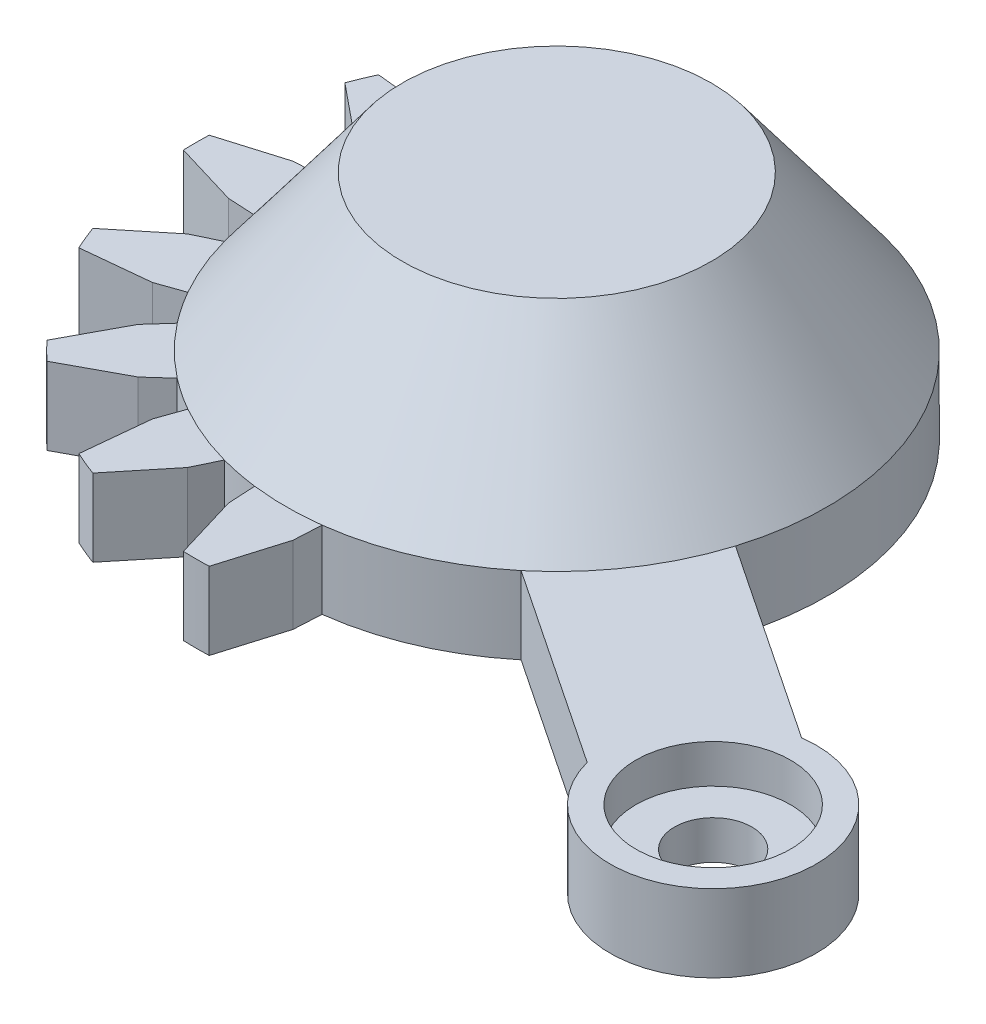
ISO-10303-21;
HEADER;
FILE_DESCRIPTION(('STEP AP214'),'2;1');
FILE_NAME('part.step','',(''),(''),'','','');
FILE_SCHEMA(('AUTOMOTIVE_DESIGN { 1 0 10303 214 1 1 1 1 }'));
ENDSEC;
DATA;
#1=APPLICATION_CONTEXT('core data for automotive mechanical design processes');
#2=APPLICATION_PROTOCOL_DEFINITION('international standard','automotive_design',2000,#1);
#3=PRODUCT_CONTEXT('',#1,'mechanical');
#4=PRODUCT('Part','Part','',(#3));
#5=PRODUCT_RELATED_PRODUCT_CATEGORY('part','',(#4));
#6=PRODUCT_DEFINITION_FORMATION('','',#4);
#7=PRODUCT_DEFINITION_CONTEXT('part definition',#1,'design');
#8=PRODUCT_DEFINITION('design','',#6,#7);
#9=PRODUCT_DEFINITION_SHAPE('','',#8);
#10=(LENGTH_UNIT() NAMED_UNIT(*) SI_UNIT(.MILLI.,.METRE.));
#11=(NAMED_UNIT(*) PLANE_ANGLE_UNIT() SI_UNIT($,.RADIAN.));
#12=(NAMED_UNIT(*) SI_UNIT($,.STERADIAN.) SOLID_ANGLE_UNIT());
#13=UNCERTAINTY_MEASURE_WITH_UNIT(LENGTH_MEASURE(1.E-05),#10,'distance_accuracy_value','');
#14=(GEOMETRIC_REPRESENTATION_CONTEXT(3) GLOBAL_UNCERTAINTY_ASSIGNED_CONTEXT((#13)) GLOBAL_UNIT_ASSIGNED_CONTEXT((#10,
#11,#12)) REPRESENTATION_CONTEXT('',''));
#15=CARTESIAN_POINT('',(0.,0.,0.));
#16=DIRECTION('',(0.,0.,1.));
#17=DIRECTION('',(1.,0.,0.));
#18=AXIS2_PLACEMENT_3D('',#15,#16,#17);
#19=CARTESIAN_POINT('',(0.,9.,0.));
#20=DIRECTION('',(0.,1.,0.));
#21=DIRECTION('',(-1.,0.,0.));
#22=AXIS2_PLACEMENT_3D('',#19,#20,#21);
#23=CYLINDRICAL_SURFACE('',#22,10.5);
#24=DIRECTION('',(0.,1.,0.));
#25=VECTOR('',#24,1.);
#26=CARTESIAN_POINT('',(-9.12480861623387,3.,-5.19498486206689));
#27=LINE('',#26,#25);
#28=CARTESIAN_POINT('',(-9.12480861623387,0.,-5.19498486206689));
#29=VERTEX_POINT('',#28);
#30=CARTESIAN_POINT('',(-9.12480861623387,3.,-5.1949848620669));
#31=VERTEX_POINT('',#30);
#32=EDGE_CURVE('E237',#29,#31,#27,.T.);
#33=ORIENTED_EDGE('',*,*,#32,.T.);
#34=CARTESIAN_POINT('',(0.,3.,0.));
#35=DIRECTION('',(0.,-1.,0.));
#36=DIRECTION('',(1.,0.,0.));
#37=AXIS2_PLACEMENT_3D('',#34,#35,#36);
#38=CIRCLE('',#37,10.5);
#39=CARTESIAN_POINT('',(-8.29145326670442,3.,-6.44218928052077));
#40=VERTEX_POINT('',#39);
#41=EDGE_CURVE('E359',#40,#31,#38,.F.);
#42=ORIENTED_EDGE('',*,*,#41,.F.);
#43=DIRECTION('',(0.,1.,0.));
#44=VECTOR('',#43,1.);
#45=CARTESIAN_POINT('',(-8.29145326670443,3.,-6.44218928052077));
#46=LINE('',#45,#44);
#47=CARTESIAN_POINT('',(-8.29145326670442,0.,-6.44218928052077));
#48=VERTEX_POINT('',#47);
#49=EDGE_CURVE('E240',#40,#48,#46,.F.);
#50=ORIENTED_EDGE('',*,*,#49,.T.);
#51=CARTESIAN_POINT('',(0.,0.,0.));
#52=DIRECTION('',(0.,1.,0.));
#53=DIRECTION('',(-1.,0.,0.));
#54=AXIS2_PLACEMENT_3D('',#51,#52,#53);
#55=CIRCLE('',#54,10.5);
#56=EDGE_CURVE('E20',#48,#29,#55,.T.);
#57=ORIENTED_EDGE('',*,*,#56,.T.);
#58=EDGE_LOOP('',(#33,#42,#50,#57));
#59=FACE_BOUND('',#58,.T.);
#60=ADVANCED_FACE('F17',(#59),#23,.T.);
#61=CARTESIAN_POINT('',(0.,9.,0.));
#62=DIRECTION('',(0.,1.,0.));
#63=DIRECTION('',(-1.,0.,0.));
#64=AXIS2_PLACEMENT_3D('',#61,#62,#63);
#65=CYLINDRICAL_SURFACE('',#64,10.5);
#66=DIRECTION('',(0.,1.,0.));
#67=VECTOR('',#66,1.);
#68=CARTESIAN_POINT('',(-10.4182585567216,3.,-1.30762710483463));
#69=LINE('',#68,#67);
#70=CARTESIAN_POINT('',(-10.4182585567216,0.,-1.30762710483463));
#71=VERTEX_POINT('',#70);
#72=CARTESIAN_POINT('',(-10.4182585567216,3.,-1.30762710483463));
#73=VERTEX_POINT('',#72);
#74=EDGE_CURVE('E352',#71,#73,#69,.T.);
#75=ORIENTED_EDGE('',*,*,#74,.T.);
#76=CARTESIAN_POINT('',(0.,3.,0.));
#77=DIRECTION('',(0.,-1.,0.));
#78=DIRECTION('',(1.,0.,0.));
#79=AXIS2_PLACEMENT_3D('',#76,#77,#78);
#80=CIRCLE('',#79,10.5);
#81=CARTESIAN_POINT('',(-10.1256230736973,3.,-2.77880502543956));
#82=VERTEX_POINT('',#81);
#83=EDGE_CURVE('E300',#82,#73,#80,.F.);
#84=ORIENTED_EDGE('',*,*,#83,.F.);
#85=DIRECTION('',(0.,1.,0.));
#86=VECTOR('',#85,1.);
#87=CARTESIAN_POINT('',(-10.1256230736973,3.,-2.77880502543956));
#88=LINE('',#87,#86);
#89=CARTESIAN_POINT('',(-10.1256230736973,0.,-2.77880502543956));
#90=VERTEX_POINT('',#89);
#91=EDGE_CURVE('E360',#82,#90,#88,.F.);
#92=ORIENTED_EDGE('',*,*,#91,.T.);
#93=CARTESIAN_POINT('',(0.,0.,0.));
#94=DIRECTION('',(0.,1.,0.));
#95=DIRECTION('',(-1.,0.,0.));
#96=AXIS2_PLACEMENT_3D('',#93,#94,#95);
#97=CIRCLE('',#96,10.5);
#98=EDGE_CURVE('E241',#90,#71,#97,.T.);
#99=ORIENTED_EDGE('',*,*,#98,.T.);
#100=EDGE_LOOP('',(#75,#84,#92,#99));
#101=FACE_BOUND('',#100,.T.);
#102=ADVANCED_FACE('F455',(#101),#65,.T.);
#103=CARTESIAN_POINT('',(0.,9.,0.));
#104=DIRECTION('',(0.,1.,0.));
#105=DIRECTION('',(-1.,0.,0.));
#106=AXIS2_PLACEMENT_3D('',#103,#104,#105);
#107=CYLINDRICAL_SURFACE('',#106,10.5);
#108=DIRECTION('',(0.,1.,0.));
#109=VECTOR('',#108,1.);
#110=CARTESIAN_POINT('',(-10.1256230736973,3.,2.77880502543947));
#111=LINE('',#110,#109);
#112=CARTESIAN_POINT('',(-10.1256230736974,0.,2.77880502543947));
#113=VERTEX_POINT('',#112);
#114=CARTESIAN_POINT('',(-10.1256230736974,3.,2.77880502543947));
#115=VERTEX_POINT('',#114);
#116=EDGE_CURVE('E340',#113,#115,#111,.T.);
#117=ORIENTED_EDGE('',*,*,#116,.T.);
#118=CARTESIAN_POINT('',(0.,3.,0.));
#119=DIRECTION('',(0.,1.,0.));
#120=DIRECTION('',(-1.,0.,0.));
#121=AXIS2_PLACEMENT_3D('',#118,#119,#120);
#122=CIRCLE('',#121,10.5);
#123=CARTESIAN_POINT('',(-10.4182585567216,3.,1.30762710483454));
#124=VERTEX_POINT('',#123);
#125=EDGE_CURVE('E345',#115,#124,#122,.F.);
#126=ORIENTED_EDGE('',*,*,#125,.T.);
#127=DIRECTION('',(0.,1.,0.));
#128=VECTOR('',#127,1.);
#129=CARTESIAN_POINT('',(-10.4182585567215,3.,1.30762710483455));
#130=LINE('',#129,#128);
#131=CARTESIAN_POINT('',(-10.4182585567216,0.,1.30762710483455));
#132=VERTEX_POINT('',#131);
#133=EDGE_CURVE('E348',#124,#132,#130,.F.);
#134=ORIENTED_EDGE('',*,*,#133,.T.);
#135=CARTESIAN_POINT('',(0.,0.,0.));
#136=DIRECTION('',(0.,1.,0.));
#137=DIRECTION('',(-1.,0.,0.));
#138=AXIS2_PLACEMENT_3D('',#135,#136,#137);
#139=CIRCLE('',#138,10.5);
#140=EDGE_CURVE('E347',#132,#113,#139,.T.);
#141=ORIENTED_EDGE('',*,*,#140,.T.);
#142=EDGE_LOOP('',(#117,#126,#134,#141));
#143=FACE_BOUND('',#142,.T.);
#144=ADVANCED_FACE('F1012',(#143),#107,.T.);
#145=CARTESIAN_POINT('',(0.,9.,0.));
#146=DIRECTION('',(0.,1.,0.));
#147=DIRECTION('',(-1.,0.,0.));
#148=AXIS2_PLACEMENT_3D('',#145,#146,#147);
#149=CYLINDRICAL_SURFACE('',#148,10.5);
#150=DIRECTION('',(0.,1.,0.));
#151=VECTOR('',#150,1.);
#152=CARTESIAN_POINT('',(-8.29145326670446,3.,6.44218928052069));
#153=LINE('',#152,#151);
#154=CARTESIAN_POINT('',(-8.29145326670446,0.,6.4421892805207));
#155=VERTEX_POINT('',#154);
#156=CARTESIAN_POINT('',(-8.29145326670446,3.,6.4421892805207));
#157=VERTEX_POINT('',#156);
#158=EDGE_CURVE('E328',#155,#157,#153,.T.);
#159=ORIENTED_EDGE('',*,*,#158,.T.);
#160=CARTESIAN_POINT('',(0.,3.,0.));
#161=DIRECTION('',(0.,1.,0.));
#162=DIRECTION('',(-1.,0.,0.));
#163=AXIS2_PLACEMENT_3D('',#160,#161,#162);
#164=CIRCLE('',#163,10.5);
#165=CARTESIAN_POINT('',(-9.12480861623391,3.,5.19498486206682));
#166=VERTEX_POINT('',#165);
#167=EDGE_CURVE('E333',#157,#166,#164,.F.);
#168=ORIENTED_EDGE('',*,*,#167,.T.);
#169=DIRECTION('',(0.,1.,0.));
#170=VECTOR('',#169,1.);
#171=CARTESIAN_POINT('',(-9.1248086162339,3.,5.19498486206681));
#172=LINE('',#171,#170);
#173=CARTESIAN_POINT('',(-9.12480861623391,0.,5.19498486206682));
#174=VERTEX_POINT('',#173);
#175=EDGE_CURVE('E336',#166,#174,#172,.F.);
#176=ORIENTED_EDGE('',*,*,#175,.T.);
#177=CARTESIAN_POINT('',(0.,0.,0.));
#178=DIRECTION('',(0.,1.,0.));
#179=DIRECTION('',(-1.,0.,0.));
#180=AXIS2_PLACEMENT_3D('',#177,#178,#179);
#181=CIRCLE('',#180,10.5);
#182=EDGE_CURVE('E335',#174,#155,#181,.T.);
#183=ORIENTED_EDGE('',*,*,#182,.T.);
#184=EDGE_LOOP('',(#159,#168,#176,#183));
#185=FACE_BOUND('',#184,.T.);
#186=ADVANCED_FACE('F991',(#185),#149,.T.);
#187=CARTESIAN_POINT('',(0.,9.,0.));
#188=DIRECTION('',(0.,1.,0.));
#189=DIRECTION('',(-1.,0.,0.));
#190=AXIS2_PLACEMENT_3D('',#187,#188,#189);
#191=CYLINDRICAL_SURFACE('',#190,10.5);
#192=DIRECTION('',(0.,1.,0.));
#193=VECTOR('',#192,1.);
#194=CARTESIAN_POINT('',(-5.19498486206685,3.,9.1248086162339));
#195=LINE('',#194,#193);
#196=CARTESIAN_POINT('',(-5.19498486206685,0.,9.1248086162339));
#197=VERTEX_POINT('',#196);
#198=CARTESIAN_POINT('',(-5.19498486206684,3.,9.1248086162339));
#199=VERTEX_POINT('',#198);
#200=EDGE_CURVE('E316',#197,#199,#195,.T.);
#201=ORIENTED_EDGE('',*,*,#200,.T.);
#202=CARTESIAN_POINT('',(0.,3.,0.));
#203=DIRECTION('',(0.,1.,0.));
#204=DIRECTION('',(-1.,0.,0.));
#205=AXIS2_PLACEMENT_3D('',#202,#203,#204);
#206=CIRCLE('',#205,10.5);
#207=CARTESIAN_POINT('',(-6.44218928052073,3.,8.29145326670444));
#208=VERTEX_POINT('',#207);
#209=EDGE_CURVE('E321',#199,#208,#206,.F.);
#210=ORIENTED_EDGE('',*,*,#209,.T.);
#211=DIRECTION('',(0.,1.,0.));
#212=VECTOR('',#211,1.);
#213=CARTESIAN_POINT('',(-6.44218928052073,3.,8.29145326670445));
#214=LINE('',#213,#212);
#215=CARTESIAN_POINT('',(-6.44218928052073,0.,8.29145326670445));
#216=VERTEX_POINT('',#215);
#217=EDGE_CURVE('E324',#208,#216,#214,.F.);
#218=ORIENTED_EDGE('',*,*,#217,.T.);
#219=CARTESIAN_POINT('',(0.,0.,0.));
#220=DIRECTION('',(0.,1.,0.));
#221=DIRECTION('',(-1.,0.,0.));
#222=AXIS2_PLACEMENT_3D('',#219,#220,#221);
#223=CIRCLE('',#222,10.5);
#224=EDGE_CURVE('E323',#216,#197,#223,.T.);
#225=ORIENTED_EDGE('',*,*,#224,.T.);
#226=EDGE_LOOP('',(#201,#210,#218,#225));
#227=FACE_BOUND('',#226,.T.);
#228=ADVANCED_FACE('F964',(#227),#191,.T.);
#229=CARTESIAN_POINT('',(0.,9.,0.));
#230=DIRECTION('',(0.,1.,0.));
#231=DIRECTION('',(-1.,0.,0.));
#232=AXIS2_PLACEMENT_3D('',#229,#230,#231);
#233=CYLINDRICAL_SURFACE('',#232,10.5);
#234=DIRECTION('',(0.,1.,0.));
#235=VECTOR('',#234,1.);
#236=CARTESIAN_POINT('',(-1.30762710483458,3.,10.4182585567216));
#237=LINE('',#236,#235);
#238=CARTESIAN_POINT('',(-1.30762710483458,0.,10.4182585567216));
#239=VERTEX_POINT('',#238);
#240=CARTESIAN_POINT('',(-1.30762710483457,3.,10.4182585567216));
#241=VERTEX_POINT('',#240);
#242=EDGE_CURVE('E303',#239,#241,#237,.T.);
#243=ORIENTED_EDGE('',*,*,#242,.T.);
#244=CARTESIAN_POINT('',(0.,3.,0.));
#245=DIRECTION('',(0.,1.,0.));
#246=DIRECTION('',(-1.,0.,0.));
#247=AXIS2_PLACEMENT_3D('',#244,#245,#246);
#248=CIRCLE('',#247,10.5);
#249=CARTESIAN_POINT('',(-2.7788050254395,3.,10.1256230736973));
#250=VERTEX_POINT('',#249);
#251=EDGE_CURVE('E308',#241,#250,#248,.F.);
#252=ORIENTED_EDGE('',*,*,#251,.T.);
#253=DIRECTION('',(0.,1.,0.));
#254=VECTOR('',#253,1.);
#255=CARTESIAN_POINT('',(-2.77880502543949,3.,10.1256230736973));
#256=LINE('',#255,#254);
#257=CARTESIAN_POINT('',(-2.7788050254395,0.,10.1256230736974));
#258=VERTEX_POINT('',#257);
#259=EDGE_CURVE('E312',#250,#258,#256,.F.);
#260=ORIENTED_EDGE('',*,*,#259,.T.);
#261=CARTESIAN_POINT('',(0.,0.,0.));
#262=DIRECTION('',(0.,1.,0.));
#263=DIRECTION('',(-1.,0.,0.));
#264=AXIS2_PLACEMENT_3D('',#261,#262,#263);
#265=CIRCLE('',#264,10.5);
#266=EDGE_CURVE('E311',#258,#239,#265,.T.);
#267=ORIENTED_EDGE('',*,*,#266,.T.);
#268=EDGE_LOOP('',(#243,#252,#260,#267));
#269=FACE_BOUND('',#268,.T.);
#270=ADVANCED_FACE('F933',(#269),#233,.T.);
#271=CARTESIAN_POINT('',(6.,9.,0.));
#272=DIRECTION('',(0.,-1.,0.));
#273=DIRECTION('',(1.,0.,0.));
#274=AXIS2_PLACEMENT_3D('',#271,#272,#273);
#275=PLANE('',#274);
#276=CARTESIAN_POINT('',(0.,9.,0.));
#277=DIRECTION('',(0.,-1.,0.));
#278=DIRECTION('',(0.,0.,-1.));
#279=AXIS2_PLACEMENT_3D('',#276,#277,#278);
#280=CIRCLE('',#279,6.);
#281=CARTESIAN_POINT('',(0.,9.,-6.));
#282=VERTEX_POINT('',#281);
#283=EDGE_CURVE('E411',#282,#282,#280,.T.);
#284=ORIENTED_EDGE('',*,*,#283,.F.);
#285=EDGE_LOOP('',(#284));
#286=FACE_BOUND('',#285,.T.);
#287=ADVANCED_FACE('F1441',(#286),#275,.F.);
#288=CARTESIAN_POINT('',(18.2923314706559,3.,12.2225451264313));
#289=DIRECTION('',(0.,1.,0.));
#290=DIRECTION('',(-1.,0.,0.));
#291=AXIS2_PLACEMENT_3D('',#288,#289,#290);
#292=CYLINDRICAL_SURFACE('',#291,3.);
#293=CARTESIAN_POINT('',(18.2923314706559,3.,12.2225451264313));
#294=DIRECTION('',(0.,1.,0.));
#295=DIRECTION('',(-1.,0.,0.));
#296=AXIS2_PLACEMENT_3D('',#293,#294,#295);
#297=CIRCLE('',#296,3.);
#298=CARTESIAN_POINT('',(15.2923314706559,3.,12.2225451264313));
#299=VERTEX_POINT('',#298);
#300=EDGE_CURVE('E392',#299,#299,#297,.F.);
#301=ORIENTED_EDGE('',*,*,#300,.F.);
#302=EDGE_LOOP('',(#301));
#303=FACE_BOUND('',#302,.T.);
#304=CARTESIAN_POINT('',(18.2923314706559,1.5,12.2225451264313));
#305=DIRECTION('',(0.,1.,0.));
#306=DIRECTION('',(-1.,0.,0.));
#307=AXIS2_PLACEMENT_3D('',#304,#305,#306);
#308=CIRCLE('',#307,3.);
#309=CARTESIAN_POINT('',(15.2923314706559,1.5,12.2225451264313));
#310=VERTEX_POINT('',#309);
#311=EDGE_CURVE('E310',#310,#310,#308,.F.);
#312=ORIENTED_EDGE('',*,*,#311,.T.);
#313=EDGE_LOOP('',(#312));
#314=FACE_BOUND('',#313,.T.);
#315=ADVANCED_FACE('F1432',(#303,#314),#292,.F.);
#316=CARTESIAN_POINT('',(19.7923314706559,1.5,12.2225451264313));
#317=DIRECTION('',(0.,-1.,0.));
#318=DIRECTION('',(1.,0.,0.));
#319=AXIS2_PLACEMENT_3D('',#316,#317,#318);
#320=PLANE('',#319);
#321=ORIENTED_EDGE('',*,*,#311,.F.);
#322=EDGE_LOOP('',(#321));
#323=FACE_BOUND('',#322,.T.);
#324=CARTESIAN_POINT('',(18.2923314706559,1.5,12.2225451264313));
#325=DIRECTION('',(0.,1.,0.));
#326=DIRECTION('',(-1.,0.,0.));
#327=AXIS2_PLACEMENT_3D('',#324,#325,#326);
#328=CIRCLE('',#327,1.5);
#329=CARTESIAN_POINT('',(16.7923314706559,1.5,12.2225451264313));
#330=VERTEX_POINT('',#329);
#331=EDGE_CURVE('E385',#330,#330,#328,.F.);
#332=ORIENTED_EDGE('',*,*,#331,.T.);
#333=EDGE_LOOP('',(#332));
#334=FACE_BOUND('',#333,.T.);
#335=ADVANCED_FACE('F1423',(#323,#334),#320,.F.);
#336=CARTESIAN_POINT('',(-7.24152903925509,3.,-9.00929599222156));
#337=DIRECTION('',(-0.668160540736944,0.,0.744017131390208));
#338=DIRECTION('',(0.744017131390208,0.,0.668160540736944));
#339=AXIS2_PLACEMENT_3D('',#336,#337,#338);
#340=PLANE('',#339);
#341=DIRECTION('',(0.,1.,0.));
#342=VECTOR('',#341,1.);
#343=CARTESIAN_POINT('',(-7.24152903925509,3.,-9.00929599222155));
#344=LINE('',#343,#342);
#345=CARTESIAN_POINT('',(-7.24152903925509,0.,-9.00929599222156));
#346=VERTEX_POINT('',#345);
#347=CARTESIAN_POINT('',(-7.24152903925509,3.,-9.00929599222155));
#348=VERTEX_POINT('',#347);
#349=EDGE_CURVE('E293',#346,#348,#344,.T.);
#350=ORIENTED_EDGE('',*,*,#349,.T.);
#351=DIRECTION('',(-0.74401713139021,0.,-0.668160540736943));
#352=VECTOR('',#351,1.);
#353=CARTESIAN_POINT('',(-6.44218928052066,3.,-8.2914532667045));
#354=LINE('',#353,#352);
#355=CARTESIAN_POINT('',(-6.44218928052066,3.,-8.2914532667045));
#356=VERTEX_POINT('',#355);
#357=EDGE_CURVE('E274',#356,#348,#354,.T.);
#358=ORIENTED_EDGE('',*,*,#357,.F.);
#359=DIRECTION('',(0.,1.,0.));
#360=VECTOR('',#359,1.);
#361=CARTESIAN_POINT('',(-6.44218928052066,9.,-8.2914532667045));
#362=LINE('',#361,#360);
#363=CARTESIAN_POINT('',(-6.44218928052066,0.,-8.2914532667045));
#364=VERTEX_POINT('',#363);
#365=EDGE_CURVE('E388',#364,#356,#362,.T.);
#366=ORIENTED_EDGE('',*,*,#365,.F.);
#367=DIRECTION('',(0.744017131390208,0.,0.668160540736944));
#368=VECTOR('',#367,1.);
#369=CARTESIAN_POINT('',(-7.24152903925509,0.,-9.00929599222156));
#370=LINE('',#369,#368);
#371=EDGE_CURVE('E296',#346,#364,#370,.T.);
#372=ORIENTED_EDGE('',*,*,#371,.F.);
#373=EDGE_LOOP('',(#350,#358,#366,#372));
#374=FACE_BOUND('',#373,.T.);
#375=ADVANCED_FACE('F1414',(#374),#340,.F.);
#376=CARTESIAN_POINT('',(0.,3.,0.));
#377=DIRECTION('',(0.,-1.,0.));
#378=DIRECTION('',(1.,0.,0.));
#379=AXIS2_PLACEMENT_3D('',#376,#377,#378);
#380=CYLINDRICAL_SURFACE('',#379,14.);
#381=CARTESIAN_POINT('',(0.,3.,0.));
#382=DIRECTION('',(0.,-1.,0.));
#383=DIRECTION('',(1.,0.,0.));
#384=AXIS2_PLACEMENT_3D('',#381,#382,#383);
#385=CIRCLE('',#384,14.);
#386=CARTESIAN_POINT('',(-9.53962607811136,3.,-10.246732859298));
#387=VERTEX_POINT('',#386);
#388=CARTESIAN_POINT('',(-10.2467328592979,3.,-9.53962607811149));
#389=VERTEX_POINT('',#388);
#390=EDGE_CURVE('E445',#387,#389,#385,.F.);
#391=ORIENTED_EDGE('',*,*,#390,.F.);
#392=DIRECTION('',(0.,1.,0.));
#393=VECTOR('',#392,1.);
#394=CARTESIAN_POINT('',(-9.53962607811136,3.,-10.246732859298));
#395=LINE('',#394,#393);
#396=CARTESIAN_POINT('',(-9.53962607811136,0.,-10.246732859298));
#397=VERTEX_POINT('',#396);
#398=EDGE_CURVE('E292',#387,#397,#395,.F.);
#399=ORIENTED_EDGE('',*,*,#398,.T.);
#400=CARTESIAN_POINT('',(0.,0.,0.));
#401=DIRECTION('',(0.,-1.,0.));
#402=DIRECTION('',(1.,0.,0.));
#403=AXIS2_PLACEMENT_3D('',#400,#401,#402);
#404=CIRCLE('',#403,14.);
#405=CARTESIAN_POINT('',(-10.2467328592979,0.,-9.53962607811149));
#406=VERTEX_POINT('',#405);
#407=EDGE_CURVE('E299',#397,#406,#404,.F.);
#408=ORIENTED_EDGE('',*,*,#407,.T.);
#409=DIRECTION('',(0.,1.,0.));
#410=VECTOR('',#409,1.);
#411=CARTESIAN_POINT('',(-10.2467328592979,3.,-9.53962607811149));
#412=LINE('',#411,#410);
#413=EDGE_CURVE('E281',#406,#389,#412,.T.);
#414=ORIENTED_EDGE('',*,*,#413,.T.);
#415=EDGE_LOOP('',(#391,#399,#408,#414));
#416=FACE_BOUND('',#415,.T.);
#417=ADVANCED_FACE('F1405',(#416),#380,.T.);
#418=CARTESIAN_POINT('',(0.,3.,0.));
#419=DIRECTION('',(0.,1.,0.));
#420=DIRECTION('',(-1.,0.,0.));
#421=AXIS2_PLACEMENT_3D('',#418,#419,#420);
#422=PLANE('',#421);
#423=ORIENTED_EDGE('',*,*,#357,.T.);
#424=DIRECTION('',(0.880471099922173,0.,0.474099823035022));
#425=VECTOR('',#424,1.);
#426=CARTESIAN_POINT('',(-9.53962607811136,3.,-10.246732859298));
#427=LINE('',#426,#425);
#428=EDGE_CURVE('E289',#348,#387,#427,.F.);
#429=ORIENTED_EDGE('',*,*,#428,.T.);
#430=ORIENTED_EDGE('',*,*,#390,.T.);
#431=DIRECTION('',(-0.474099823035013,0.,-0.880471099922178));
#432=VECTOR('',#431,1.);
#433=CARTESIAN_POINT('',(-10.2467328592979,3.,-9.53962607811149));
#434=LINE('',#433,#432);
#435=CARTESIAN_POINT('',(-9.00929599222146,3.,-7.24152903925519));
#436=VERTEX_POINT('',#435);
#437=EDGE_CURVE('E277',#389,#436,#434,.F.);
#438=ORIENTED_EDGE('',*,*,#437,.T.);
#439=DIRECTION('',(-0.668160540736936,0.,-0.744017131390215));
#440=VECTOR('',#439,1.);
#441=CARTESIAN_POINT('',(-9.00929599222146,3.,-7.24152903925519));
#442=LINE('',#441,#440);
#443=EDGE_CURVE('E271',#436,#40,#442,.F.);
#444=ORIENTED_EDGE('',*,*,#443,.T.);
#445=CARTESIAN_POINT('',(0.,3.,0.));
#446=DIRECTION('',(0.,-1.,0.));
#447=DIRECTION('',(0.,0.,-1.));
#448=AXIS2_PLACEMENT_3D('',#445,#446,#447);
#449=CIRCLE('',#448,10.5);
#450=EDGE_CURVE('E286',#40,#356,#449,.T.);
#451=ORIENTED_EDGE('',*,*,#450,.T.);
#452=EDGE_LOOP('',(#423,#429,#430,#438,#444,#451));
#453=FACE_BOUND('',#452,.T.);
#454=ADVANCED_FACE('F1396',(#453),#422,.T.);
#455=CARTESIAN_POINT('',(-9.00929599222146,3.,-7.24152903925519));
#456=DIRECTION('',(0.744017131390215,0.,-0.668160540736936));
#457=DIRECTION('',(-0.668160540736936,0.,-0.744017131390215));
#458=AXIS2_PLACEMENT_3D('',#455,#456,#457);
#459=PLANE('',#458);
#460=ORIENTED_EDGE('',*,*,#49,.F.);
#461=ORIENTED_EDGE('',*,*,#443,.F.);
#462=DIRECTION('',(0.,1.,0.));
#463=VECTOR('',#462,1.);
#464=CARTESIAN_POINT('',(-9.00929599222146,3.,-7.24152903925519));
#465=LINE('',#464,#463);
#466=CARTESIAN_POINT('',(-9.00929599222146,0.,-7.24152903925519));
#467=VERTEX_POINT('',#466);
#468=EDGE_CURVE('E280',#436,#467,#465,.F.);
#469=ORIENTED_EDGE('',*,*,#468,.T.);
#470=DIRECTION('',(-0.668160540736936,0.,-0.744017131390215));
#471=VECTOR('',#470,1.);
#472=CARTESIAN_POINT('',(-9.00929599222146,0.,-7.24152903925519));
#473=LINE('',#472,#471);
#474=EDGE_CURVE('E250',#48,#467,#473,.T.);
#475=ORIENTED_EDGE('',*,*,#474,.F.);
#476=EDGE_LOOP('',(#460,#461,#469,#475));
#477=FACE_BOUND('',#476,.T.);
#478=ADVANCED_FACE('F1388',(#477),#459,.F.);
#479=CARTESIAN_POINT('',(-10.1380087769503,3.,-5.55229098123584));
#480=DIRECTION('',(-0.332576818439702,0.,0.943076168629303));
#481=DIRECTION('',(0.943076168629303,0.,0.332576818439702));
#482=AXIS2_PLACEMENT_3D('',#479,#480,#481);
#483=PLANE('',#482);
#484=DIRECTION('',(0.,1.,0.));
#485=VECTOR('',#484,1.);
#486=CARTESIAN_POINT('',(-10.1380087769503,3.,-5.55229098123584));
#487=LINE('',#486,#485);
#488=CARTESIAN_POINT('',(-10.1380087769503,0.,-5.55229098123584));
#489=VERTEX_POINT('',#488);
#490=CARTESIAN_POINT('',(-10.1380087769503,3.,-5.55229098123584));
#491=VERTEX_POINT('',#490);
#492=EDGE_CURVE('E496',#489,#491,#487,.T.);
#493=ORIENTED_EDGE('',*,*,#492,.T.);
#494=DIRECTION('',(-0.943076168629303,0.,-0.332576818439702));
#495=VECTOR('',#494,1.);
#496=CARTESIAN_POINT('',(-9.12480861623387,3.,-5.1949848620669));
#497=LINE('',#496,#495);
#498=EDGE_CURVE('E249',#31,#491,#497,.T.);
#499=ORIENTED_EDGE('',*,*,#498,.F.);
#500=ORIENTED_EDGE('',*,*,#32,.F.);
#501=DIRECTION('',(0.943076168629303,0.,0.332576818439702));
#502=VECTOR('',#501,1.);
#503=CARTESIAN_POINT('',(-10.1380087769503,0.,-5.55229098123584));
#504=LINE('',#503,#502);
#505=EDGE_CURVE('E246',#489,#29,#504,.T.);
#506=ORIENTED_EDGE('',*,*,#505,.F.);
#507=EDGE_LOOP('',(#493,#499,#500,#506));
#508=FACE_BOUND('',#507,.T.);
#509=ADVANCED_FACE('F245',(#508),#483,.F.);
#510=CARTESIAN_POINT('',(0.,3.,0.));
#511=DIRECTION('',(0.,-1.,0.));
#512=DIRECTION('',(1.,0.,0.));
#513=AXIS2_PLACEMENT_3D('',#510,#511,#512);
#514=CYLINDRICAL_SURFACE('',#513,14.);
#515=CARTESIAN_POINT('',(0.,3.,0.));
#516=DIRECTION('',(0.,-1.,0.));
#517=DIRECTION('',(1.,0.,0.));
#518=AXIS2_PLACEMENT_3D('',#515,#516,#517);
#519=CIRCLE('',#518,14.);
#520=CARTESIAN_POINT('',(-12.7347201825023,3.,-5.81608991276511));
#521=VERTEX_POINT('',#520);
#522=CARTESIAN_POINT('',(-13.1174036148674,3.,-4.89221038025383));
#523=VERTEX_POINT('',#522);
#524=EDGE_CURVE('E260',#521,#523,#519,.F.);
#525=ORIENTED_EDGE('',*,*,#524,.F.);
#526=DIRECTION('',(0.,1.,0.));
#527=VECTOR('',#526,1.);
#528=CARTESIAN_POINT('',(-12.7347201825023,3.,-5.81608991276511));
#529=LINE('',#528,#527);
#530=CARTESIAN_POINT('',(-12.7347201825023,0.,-5.81608991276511));
#531=VERTEX_POINT('',#530);
#532=EDGE_CURVE('E495',#521,#531,#529,.F.);
#533=ORIENTED_EDGE('',*,*,#532,.T.);
#534=CARTESIAN_POINT('',(0.,0.,0.));
#535=DIRECTION('',(0.,-1.,0.));
#536=DIRECTION('',(1.,0.,0.));
#537=AXIS2_PLACEMENT_3D('',#534,#535,#536);
#538=CIRCLE('',#537,14.);
#539=CARTESIAN_POINT('',(-13.1174036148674,0.,-4.89221038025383));
#540=VERTEX_POINT('',#539);
#541=EDGE_CURVE('E258',#531,#540,#538,.F.);
#542=ORIENTED_EDGE('',*,*,#541,.T.);
#543=DIRECTION('',(0.,1.,0.));
#544=VECTOR('',#543,1.);
#545=CARTESIAN_POINT('',(-13.1174036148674,3.,-4.89221038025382));
#546=LINE('',#545,#544);
#547=EDGE_CURVE('E488',#540,#523,#546,.T.);
#548=ORIENTED_EDGE('',*,*,#547,.T.);
#549=EDGE_LOOP('',(#525,#533,#542,#548));
#550=FACE_BOUND('',#549,.T.);
#551=ADVANCED_FACE('F692',(#550),#514,.T.);
#552=CARTESIAN_POINT('',(0.,3.,0.));
#553=DIRECTION('',(0.,1.,0.));
#554=DIRECTION('',(-1.,0.,0.));
#555=AXIS2_PLACEMENT_3D('',#552,#553,#554);
#556=PLANE('',#555);
#557=ORIENTED_EDGE('',*,*,#498,.T.);
#558=DIRECTION('',(0.994879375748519,0.,0.101069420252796));
#559=VECTOR('',#558,1.);
#560=CARTESIAN_POINT('',(-12.7347201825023,3.,-5.81608991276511));
#561=LINE('',#560,#559);
#562=EDGE_CURVE('E493',#491,#521,#561,.F.);
#563=ORIENTED_EDGE('',*,*,#562,.T.);
#564=ORIENTED_EDGE('',*,*,#524,.T.);
#565=DIRECTION('',(-0.774952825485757,0.,-0.632019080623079));
#566=VECTOR('',#565,1.);
#567=CARTESIAN_POINT('',(-13.1174036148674,3.,-4.89221038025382));
#568=LINE('',#567,#566);
#569=CARTESIAN_POINT('',(-11.094717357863,3.,-3.24259214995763));
#570=VERTEX_POINT('',#569);
#571=EDGE_CURVE('E484',#523,#570,#568,.F.);
#572=ORIENTED_EDGE('',*,*,#571,.T.);
#573=DIRECTION('',(-0.902022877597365,0.,-0.431688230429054));
#574=VECTOR('',#573,1.);
#575=CARTESIAN_POINT('',(-11.094717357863,3.,-3.24259214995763));
#576=LINE('',#575,#574);
#577=EDGE_CURVE('E362',#570,#82,#576,.F.);
#578=ORIENTED_EDGE('',*,*,#577,.T.);
#579=CARTESIAN_POINT('',(0.,3.,0.));
#580=DIRECTION('',(0.,-1.,0.));
#581=DIRECTION('',(0.,0.,-1.));
#582=AXIS2_PLACEMENT_3D('',#579,#580,#581);
#583=CIRCLE('',#582,10.5);
#584=EDGE_CURVE('E439',#82,#31,#583,.T.);
#585=ORIENTED_EDGE('',*,*,#584,.T.);
#586=EDGE_LOOP('',(#557,#563,#564,#572,#578,#585));
#587=FACE_BOUND('',#586,.T.);
#588=ADVANCED_FACE('F1365',(#587),#556,.T.);
#589=CARTESIAN_POINT('',(-11.094717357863,3.,-3.24259214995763));
#590=DIRECTION('',(0.431688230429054,0.,-0.902022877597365));
#591=DIRECTION('',(-0.902022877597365,0.,-0.431688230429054));
#592=AXIS2_PLACEMENT_3D('',#589,#590,#591);
#593=PLANE('',#592);
#594=ORIENTED_EDGE('',*,*,#91,.F.);
#595=ORIENTED_EDGE('',*,*,#577,.F.);
#596=DIRECTION('',(0.,1.,0.));
#597=VECTOR('',#596,1.);
#598=CARTESIAN_POINT('',(-11.094717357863,3.,-3.24259214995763));
#599=LINE('',#598,#597);
#600=CARTESIAN_POINT('',(-11.094717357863,0.,-3.24259214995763));
#601=VERTEX_POINT('',#600);
#602=EDGE_CURVE('E487',#570,#601,#599,.F.);
#603=ORIENTED_EDGE('',*,*,#602,.T.);
#604=DIRECTION('',(-0.902022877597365,0.,-0.431688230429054));
#605=VECTOR('',#604,1.);
#606=CARTESIAN_POINT('',(-11.094717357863,0.,-3.24259214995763));
#607=LINE('',#606,#605);
#608=EDGE_CURVE('E356',#90,#601,#607,.T.);
#609=ORIENTED_EDGE('',*,*,#608,.F.);
#610=EDGE_LOOP('',(#594,#595,#603,#609));
#611=FACE_BOUND('',#610,.T.);
#612=ADVANCED_FACE('F1357',(#611),#593,.F.);
#613=CARTESIAN_POINT('',(-11.4910685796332,3.,-1.25000000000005));
#614=DIRECTION('',(0.0536387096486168,0.,0.998560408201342));
#615=DIRECTION('',(0.998560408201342,0.,-0.0536387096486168));
#616=AXIS2_PLACEMENT_3D('',#613,#614,#615);
#617=PLANE('',#616);
#618=DIRECTION('',(0.,1.,0.));
#619=VECTOR('',#618,1.);
#620=CARTESIAN_POINT('',(-11.4910685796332,3.,-1.25000000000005));
#621=LINE('',#620,#619);
#622=CARTESIAN_POINT('',(-11.4910685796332,0.,-1.25000000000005));
#623=VERTEX_POINT('',#622);
#624=CARTESIAN_POINT('',(-11.4910685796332,3.,-1.25000000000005));
#625=VERTEX_POINT('',#624);
#626=EDGE_CURVE('E676',#623,#625,#621,.T.);
#627=ORIENTED_EDGE('',*,*,#626,.T.);
#628=DIRECTION('',(-0.998560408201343,0.,0.0536387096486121));
#629=VECTOR('',#628,1.);
#630=CARTESIAN_POINT('',(-10.4182585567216,3.,-1.30762710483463));
#631=LINE('',#630,#629);
#632=EDGE_CURVE('E436',#73,#625,#631,.T.);
#633=ORIENTED_EDGE('',*,*,#632,.F.);
#634=ORIENTED_EDGE('',*,*,#74,.F.);
#635=DIRECTION('',(0.998560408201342,0.,-0.0536387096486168));
#636=VECTOR('',#635,1.);
#637=CARTESIAN_POINT('',(-11.4910685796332,0.,-1.25000000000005));
#638=LINE('',#637,#636);
#639=EDGE_CURVE('E355',#623,#71,#638,.T.);
#640=ORIENTED_EDGE('',*,*,#639,.F.);
#641=EDGE_LOOP('',(#627,#633,#634,#640));
#642=FACE_BOUND('',#641,.T.);
#643=ADVANCED_FACE('F464',(#642),#617,.F.);
#644=CARTESIAN_POINT('',(0.,3.,0.));
#645=DIRECTION('',(0.,-1.,0.));
#646=DIRECTION('',(1.,0.,0.));
#647=AXIS2_PLACEMENT_3D('',#644,#645,#646);
#648=CYLINDRICAL_SURFACE('',#647,14.);
#649=CARTESIAN_POINT('',(0.,3.,0.));
#650=DIRECTION('',(0.,-1.,0.));
#651=DIRECTION('',(1.,0.,0.));
#652=AXIS2_PLACEMENT_3D('',#649,#650,#651);
#653=CIRCLE('',#652,14.);
#654=CARTESIAN_POINT('',(-13.9910685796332,3.,-0.500000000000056));
#655=VERTEX_POINT('',#654);
#656=CARTESIAN_POINT('',(-13.9910685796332,3.,0.499999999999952));
#657=VERTEX_POINT('',#656);
#658=EDGE_CURVE('E434',#655,#657,#653,.F.);
#659=ORIENTED_EDGE('',*,*,#658,.F.);
#660=DIRECTION('',(0.,1.,0.));
#661=VECTOR('',#660,1.);
#662=CARTESIAN_POINT('',(-13.9910685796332,3.,-0.500000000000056));
#663=LINE('',#662,#661);
#664=CARTESIAN_POINT('',(-13.9910685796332,0.,-0.500000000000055));
#665=VERTEX_POINT('',#664);
#666=EDGE_CURVE('E675',#655,#665,#663,.F.);
#667=ORIENTED_EDGE('',*,*,#666,.T.);
#668=CARTESIAN_POINT('',(0.,0.,0.));
#669=DIRECTION('',(0.,-1.,0.));
#670=DIRECTION('',(1.,0.,0.));
#671=AXIS2_PLACEMENT_3D('',#668,#669,#670);
#672=CIRCLE('',#671,14.);
#673=CARTESIAN_POINT('',(-13.9910685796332,0.,0.499999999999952));
#674=VERTEX_POINT('',#673);
#675=EDGE_CURVE('E437',#665,#674,#672,.F.);
#676=ORIENTED_EDGE('',*,*,#675,.T.);
#677=DIRECTION('',(0.,1.,0.));
#678=VECTOR('',#677,1.);
#679=CARTESIAN_POINT('',(-13.9910685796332,3.,0.499999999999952));
#680=LINE('',#679,#678);
#681=EDGE_CURVE('E668',#674,#657,#680,.T.);
#682=ORIENTED_EDGE('',*,*,#681,.T.);
#683=EDGE_LOOP('',(#659,#667,#676,#682));
#684=FACE_BOUND('',#683,.T.);
#685=ADVANCED_FACE('F1015',(#684),#648,.T.);
#686=CARTESIAN_POINT('',(0.,3.,0.));
#687=DIRECTION('',(0.,1.,0.));
#688=DIRECTION('',(-1.,0.,0.));
#689=AXIS2_PLACEMENT_3D('',#686,#687,#688);
#690=PLANE('',#689);
#691=ORIENTED_EDGE('',*,*,#632,.T.);
#692=DIRECTION('',(0.957826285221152,0.,-0.287347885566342));
#693=VECTOR('',#692,1.);
#694=CARTESIAN_POINT('',(-13.9910685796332,3.,-0.500000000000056));
#695=LINE('',#694,#693);
#696=EDGE_CURVE('E673',#625,#655,#695,.F.);
#697=ORIENTED_EDGE('',*,*,#696,.T.);
#698=ORIENTED_EDGE('',*,*,#658,.T.);
#699=DIRECTION('',(-0.957826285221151,0.,-0.287347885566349));
#700=VECTOR('',#699,1.);
#701=CARTESIAN_POINT('',(-13.9910685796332,3.,0.499999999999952));
#702=LINE('',#701,#700);
#703=CARTESIAN_POINT('',(-11.4910685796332,3.,1.24999999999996));
#704=VERTEX_POINT('',#703);
#705=EDGE_CURVE('E664',#657,#704,#702,.F.);
#706=ORIENTED_EDGE('',*,*,#705,.T.);
#707=DIRECTION('',(-0.998560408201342,0.,-0.0536387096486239));
#708=VECTOR('',#707,1.);
#709=CARTESIAN_POINT('',(-11.4910685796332,3.,1.24999999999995));
#710=LINE('',#709,#708);
#711=EDGE_CURVE('E351',#704,#124,#710,.F.);
#712=ORIENTED_EDGE('',*,*,#711,.T.);
#713=CARTESIAN_POINT('',(0.,3.,0.));
#714=DIRECTION('',(0.,-1.,0.));
#715=DIRECTION('',(0.,0.,-1.));
#716=AXIS2_PLACEMENT_3D('',#713,#714,#715);
#717=CIRCLE('',#716,10.5);
#718=EDGE_CURVE('E408',#73,#124,#717,.F.);
#719=ORIENTED_EDGE('',*,*,#718,.F.);
#720=EDGE_LOOP('',(#691,#697,#698,#706,#712,#719));
#721=FACE_BOUND('',#720,.T.);
#722=ADVANCED_FACE('F1013',(#721),#690,.T.);
#723=CARTESIAN_POINT('',(-11.4910685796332,3.,1.24999999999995));
#724=DIRECTION('',(0.0536387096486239,0.,-0.998560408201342));
#725=DIRECTION('',(-0.998560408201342,0.,-0.0536387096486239));
#726=AXIS2_PLACEMENT_3D('',#723,#724,#725);
#727=PLANE('',#726);
#728=ORIENTED_EDGE('',*,*,#133,.F.);
#729=ORIENTED_EDGE('',*,*,#711,.F.);
#730=DIRECTION('',(0.,1.,0.));
#731=VECTOR('',#730,1.);
#732=CARTESIAN_POINT('',(-11.4910685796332,3.,1.24999999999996));
#733=LINE('',#732,#731);
#734=CARTESIAN_POINT('',(-11.4910685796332,0.,1.24999999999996));
#735=VERTEX_POINT('',#734);
#736=EDGE_CURVE('E667',#704,#735,#733,.F.);
#737=ORIENTED_EDGE('',*,*,#736,.T.);
#738=DIRECTION('',(-0.998560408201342,0.,-0.0536387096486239));
#739=VECTOR('',#738,1.);
#740=CARTESIAN_POINT('',(-11.4910685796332,0.,1.24999999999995));
#741=LINE('',#740,#739);
#742=EDGE_CURVE('E344',#132,#735,#741,.T.);
#743=ORIENTED_EDGE('',*,*,#742,.F.);
#744=EDGE_LOOP('',(#728,#729,#737,#743));
#745=FACE_BOUND('',#744,.T.);
#746=ADVANCED_FACE('F787',(#745),#727,.F.);
#747=CARTESIAN_POINT('',(-11.094717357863,3.,3.24259214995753));
#748=DIRECTION('',(0.431688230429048,0.,0.902022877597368));
#749=DIRECTION('',(0.902022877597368,0.,-0.431688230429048));
#750=AXIS2_PLACEMENT_3D('',#747,#748,#749);
#751=PLANE('',#750);
#752=DIRECTION('',(0.,1.,0.));
#753=VECTOR('',#752,1.);
#754=CARTESIAN_POINT('',(-11.094717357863,3.,3.24259214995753));
#755=LINE('',#754,#753);
#756=CARTESIAN_POINT('',(-11.094717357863,0.,3.24259214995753));
#757=VERTEX_POINT('',#756);
#758=CARTESIAN_POINT('',(-11.094717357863,3.,3.24259214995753));
#759=VERTEX_POINT('',#758);
#760=EDGE_CURVE('E649',#757,#759,#755,.T.);
#761=ORIENTED_EDGE('',*,*,#760,.T.);
#762=DIRECTION('',(-0.902022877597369,0.,0.431688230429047));
#763=VECTOR('',#762,1.);
#764=CARTESIAN_POINT('',(-10.1256230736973,3.,2.77880502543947));
#765=LINE('',#764,#763);
#766=EDGE_CURVE('E431',#115,#759,#765,.T.);
#767=ORIENTED_EDGE('',*,*,#766,.F.);
#768=ORIENTED_EDGE('',*,*,#116,.F.);
#769=DIRECTION('',(0.902022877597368,0.,-0.431688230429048));
#770=VECTOR('',#769,1.);
#771=CARTESIAN_POINT('',(-11.094717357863,0.,3.24259214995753));
#772=LINE('',#771,#770);
#773=EDGE_CURVE('E343',#757,#113,#772,.T.);
#774=ORIENTED_EDGE('',*,*,#773,.F.);
#775=EDGE_LOOP('',(#761,#767,#768,#774));
#776=FACE_BOUND('',#775,.T.);
#777=ADVANCED_FACE('F1009',(#776),#751,.F.);
#778=CARTESIAN_POINT('',(0.,3.,0.));
#779=DIRECTION('',(0.,-1.,0.));
#780=DIRECTION('',(0.,0.,-1.));
#781=AXIS2_PLACEMENT_3D('',#778,#779,#780);
#782=CYLINDRICAL_SURFACE('',#781,14.);
#783=CARTESIAN_POINT('',(0.,3.,0.));
#784=DIRECTION('',(0.,-1.,0.));
#785=DIRECTION('',(0.,0.,-1.));
#786=AXIS2_PLACEMENT_3D('',#783,#784,#785);
#787=CIRCLE('',#786,14.);
#788=CARTESIAN_POINT('',(-13.1174036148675,3.,4.89221038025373));
#789=VERTEX_POINT('',#788);
#790=CARTESIAN_POINT('',(-12.7347201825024,3.,5.81608991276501));
#791=VERTEX_POINT('',#790);
#792=EDGE_CURVE('E429',#789,#791,#787,.F.);
#793=ORIENTED_EDGE('',*,*,#792,.F.);
#794=DIRECTION('',(0.,1.,0.));
#795=VECTOR('',#794,1.);
#796=CARTESIAN_POINT('',(-13.1174036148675,3.,4.89221038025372));
#797=LINE('',#796,#795);
#798=CARTESIAN_POINT('',(-13.1174036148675,0.,4.89221038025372));
#799=VERTEX_POINT('',#798);
#800=EDGE_CURVE('E648',#789,#799,#797,.F.);
#801=ORIENTED_EDGE('',*,*,#800,.T.);
#802=CARTESIAN_POINT('',(0.,0.,0.));
#803=DIRECTION('',(0.,-1.,0.));
#804=DIRECTION('',(0.,0.,-1.));
#805=AXIS2_PLACEMENT_3D('',#802,#803,#804);
#806=CIRCLE('',#805,14.);
#807=CARTESIAN_POINT('',(-12.7347201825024,0.,5.81608991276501));
#808=VERTEX_POINT('',#807);
#809=EDGE_CURVE('E432',#799,#808,#806,.F.);
#810=ORIENTED_EDGE('',*,*,#809,.T.);
#811=DIRECTION('',(0.,1.,0.));
#812=VECTOR('',#811,1.);
#813=CARTESIAN_POINT('',(-12.7347201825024,3.,5.81608991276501));
#814=LINE('',#813,#812);
#815=EDGE_CURVE('E638',#808,#791,#814,.T.);
#816=ORIENTED_EDGE('',*,*,#815,.T.);
#817=EDGE_LOOP('',(#793,#801,#810,#816));
#818=FACE_BOUND('',#817,.T.);
#819=ADVANCED_FACE('F1004',(#818),#782,.T.);
#820=CARTESIAN_POINT('',(0.,3.,0.));
#821=DIRECTION('',(0.,1.,0.));
#822=DIRECTION('',(0.,0.,1.));
#823=AXIS2_PLACEMENT_3D('',#820,#821,#822);
#824=PLANE('',#823);
#825=ORIENTED_EDGE('',*,*,#766,.T.);
#826=DIRECTION('',(0.774952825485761,0.,-0.632019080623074));
#827=VECTOR('',#826,1.);
#828=CARTESIAN_POINT('',(-13.1174036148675,3.,4.89221038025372));
#829=LINE('',#828,#827);
#830=EDGE_CURVE('E645',#759,#789,#829,.F.);
#831=ORIENTED_EDGE('',*,*,#830,.T.);
#832=ORIENTED_EDGE('',*,*,#792,.T.);
#833=DIRECTION('',(-0.99487937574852,0.,0.10106942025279));
#834=VECTOR('',#833,1.);
#835=CARTESIAN_POINT('',(-12.7347201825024,3.,5.81608991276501));
#836=LINE('',#835,#834);
#837=CARTESIAN_POINT('',(-10.1380087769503,3.,5.55229098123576));
#838=VERTEX_POINT('',#837);
#839=EDGE_CURVE('E634',#791,#838,#836,.F.);
#840=ORIENTED_EDGE('',*,*,#839,.T.);
#841=DIRECTION('',(-0.943076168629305,0.,0.332576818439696));
#842=VECTOR('',#841,1.);
#843=CARTESIAN_POINT('',(-10.1380087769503,3.,5.55229098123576));
#844=LINE('',#843,#842);
#845=EDGE_CURVE('E339',#838,#166,#844,.F.);
#846=ORIENTED_EDGE('',*,*,#845,.T.);
#847=CARTESIAN_POINT('',(0.,3.00000000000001,0.));
#848=DIRECTION('',(0.,-1.,0.));
#849=DIRECTION('',(0.,0.,-1.));
#850=AXIS2_PLACEMENT_3D('',#847,#848,#849);
#851=CIRCLE('',#850,10.5);
#852=EDGE_CURVE('E405',#115,#166,#851,.F.);
#853=ORIENTED_EDGE('',*,*,#852,.F.);
#854=EDGE_LOOP('',(#825,#831,#832,#840,#846,#853));
#855=FACE_BOUND('',#854,.T.);
#856=ADVANCED_FACE('F994',(#855),#824,.T.);
#857=CARTESIAN_POINT('',(-10.1380087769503,3.,5.55229098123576));
#858=DIRECTION('',(-0.332576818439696,0.,-0.943076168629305));
#859=DIRECTION('',(-0.943076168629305,0.,0.332576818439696));
#860=AXIS2_PLACEMENT_3D('',#857,#858,#859);
#861=PLANE('',#860);
#862=ORIENTED_EDGE('',*,*,#175,.F.);
#863=ORIENTED_EDGE('',*,*,#845,.F.);
#864=DIRECTION('',(0.,1.,0.));
#865=VECTOR('',#864,1.);
#866=CARTESIAN_POINT('',(-10.1380087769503,3.,5.55229098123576));
#867=LINE('',#866,#865);
#868=CARTESIAN_POINT('',(-10.1380087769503,0.,5.55229098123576));
#869=VERTEX_POINT('',#868);
#870=EDGE_CURVE('E637',#838,#869,#867,.F.);
#871=ORIENTED_EDGE('',*,*,#870,.T.);
#872=DIRECTION('',(-0.943076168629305,0.,0.332576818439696));
#873=VECTOR('',#872,1.);
#874=CARTESIAN_POINT('',(-10.1380087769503,0.,5.55229098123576));
#875=LINE('',#874,#873);
#876=EDGE_CURVE('E332',#174,#869,#875,.T.);
#877=ORIENTED_EDGE('',*,*,#876,.F.);
#878=EDGE_LOOP('',(#862,#863,#871,#877));
#879=FACE_BOUND('',#878,.T.);
#880=ADVANCED_FACE('F989',(#879),#861,.F.);
#881=CARTESIAN_POINT('',(-9.00929599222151,3.,7.24152903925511));
#882=DIRECTION('',(0.744017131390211,0.,0.668160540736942));
#883=DIRECTION('',(0.668160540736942,0.,-0.744017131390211));
#884=AXIS2_PLACEMENT_3D('',#881,#882,#883);
#885=PLANE('',#884);
#886=DIRECTION('',(0.,1.,0.));
#887=VECTOR('',#886,1.);
#888=CARTESIAN_POINT('',(-9.00929599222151,3.,7.24152903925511));
#889=LINE('',#888,#887);
#890=CARTESIAN_POINT('',(-9.00929599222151,0.,7.24152903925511));
#891=VERTEX_POINT('',#890);
#892=CARTESIAN_POINT('',(-9.00929599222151,3.,7.24152903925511));
#893=VERTEX_POINT('',#892);
#894=EDGE_CURVE('E619',#891,#893,#889,.T.);
#895=ORIENTED_EDGE('',*,*,#894,.T.);
#896=DIRECTION('',(-0.668160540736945,0.,0.744017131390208));
#897=VECTOR('',#896,1.);
#898=CARTESIAN_POINT('',(-8.29145326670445,3.,6.4421892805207));
#899=LINE('',#898,#897);
#900=EDGE_CURVE('E426',#157,#893,#899,.T.);
#901=ORIENTED_EDGE('',*,*,#900,.F.);
#902=ORIENTED_EDGE('',*,*,#158,.F.);
#903=DIRECTION('',(0.668160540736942,0.,-0.744017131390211));
#904=VECTOR('',#903,1.);
#905=CARTESIAN_POINT('',(-9.00929599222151,0.,7.24152903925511));
#906=LINE('',#905,#904);
#907=EDGE_CURVE('E331',#891,#155,#906,.T.);
#908=ORIENTED_EDGE('',*,*,#907,.F.);
#909=EDGE_LOOP('',(#895,#901,#902,#908));
#910=FACE_BOUND('',#909,.T.);
#911=ADVANCED_FACE('F982',(#910),#885,.F.);
#912=CARTESIAN_POINT('',(0.,3.,0.));
#913=DIRECTION('',(0.,-1.,0.));
#914=DIRECTION('',(0.,0.,-1.));
#915=AXIS2_PLACEMENT_3D('',#912,#913,#914);
#916=CYLINDRICAL_SURFACE('',#915,14.);
#917=CARTESIAN_POINT('',(0.,3.,0.));
#918=DIRECTION('',(0.,-1.,0.));
#919=DIRECTION('',(0.,0.,-1.));
#920=AXIS2_PLACEMENT_3D('',#917,#918,#919);
#921=CIRCLE('',#920,14.);
#922=CARTESIAN_POINT('',(-10.246732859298,3.,9.5396260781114));
#923=VERTEX_POINT('',#922);
#924=CARTESIAN_POINT('',(-9.53962607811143,3.,10.2467328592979));
#925=VERTEX_POINT('',#924);
#926=EDGE_CURVE('E424',#923,#925,#921,.F.);
#927=ORIENTED_EDGE('',*,*,#926,.F.);
#928=DIRECTION('',(0.,1.,0.));
#929=VECTOR('',#928,1.);
#930=CARTESIAN_POINT('',(-10.246732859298,3.,9.53962607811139));
#931=LINE('',#930,#929);
#932=CARTESIAN_POINT('',(-10.246732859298,0.,9.5396260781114));
#933=VERTEX_POINT('',#932);
#934=EDGE_CURVE('E618',#923,#933,#931,.F.);
#935=ORIENTED_EDGE('',*,*,#934,.T.);
#936=CARTESIAN_POINT('',(0.,0.,0.));
#937=DIRECTION('',(0.,-1.,0.));
#938=DIRECTION('',(0.,0.,-1.));
#939=AXIS2_PLACEMENT_3D('',#936,#937,#938);
#940=CIRCLE('',#939,14.);
#941=CARTESIAN_POINT('',(-9.53962607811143,0.,10.2467328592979));
#942=VERTEX_POINT('',#941);
#943=EDGE_CURVE('E427',#933,#942,#940,.F.);
#944=ORIENTED_EDGE('',*,*,#943,.T.);
#945=DIRECTION('',(0.,1.,0.));
#946=VECTOR('',#945,1.);
#947=CARTESIAN_POINT('',(-9.53962607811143,3.,10.2467328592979));
#948=LINE('',#947,#946);
#949=EDGE_CURVE('E608',#942,#925,#948,.T.);
#950=ORIENTED_EDGE('',*,*,#949,.T.);
#951=EDGE_LOOP('',(#927,#935,#944,#950));
#952=FACE_BOUND('',#951,.T.);
#953=ADVANCED_FACE('F977',(#952),#916,.T.);
#954=CARTESIAN_POINT('',(0.,3.,0.));
#955=DIRECTION('',(0.,1.,0.));
#956=DIRECTION('',(0.,0.,1.));
#957=AXIS2_PLACEMENT_3D('',#954,#955,#956);
#958=PLANE('',#957);
#959=ORIENTED_EDGE('',*,*,#900,.T.);
#960=DIRECTION('',(0.474099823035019,0.,-0.880471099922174));
#961=VECTOR('',#960,1.);
#962=CARTESIAN_POINT('',(-10.246732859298,3.,9.53962607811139));
#963=LINE('',#962,#961);
#964=EDGE_CURVE('E615',#893,#923,#963,.F.);
#965=ORIENTED_EDGE('',*,*,#964,.T.);
#966=ORIENTED_EDGE('',*,*,#926,.T.);
#967=DIRECTION('',(-0.880471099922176,0.,0.474099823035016));
#968=VECTOR('',#967,1.);
#969=CARTESIAN_POINT('',(-9.53962607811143,3.,10.2467328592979));
#970=LINE('',#969,#968);
#971=CARTESIAN_POINT('',(-7.24152903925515,3.,9.00929599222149));
#972=VERTEX_POINT('',#971);
#973=EDGE_CURVE('E604',#925,#972,#970,.F.);
#974=ORIENTED_EDGE('',*,*,#973,.T.);
#975=DIRECTION('',(-0.744017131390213,0.,0.668160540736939));
#976=VECTOR('',#975,1.);
#977=CARTESIAN_POINT('',(-7.24152903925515,3.,9.00929599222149));
#978=LINE('',#977,#976);
#979=EDGE_CURVE('E327',#972,#208,#978,.F.);
#980=ORIENTED_EDGE('',*,*,#979,.T.);
#981=CARTESIAN_POINT('',(0.,3.00000000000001,0.));
#982=DIRECTION('',(0.,-1.,0.));
#983=DIRECTION('',(0.,0.,-1.));
#984=AXIS2_PLACEMENT_3D('',#981,#982,#983);
#985=CIRCLE('',#984,10.5);
#986=EDGE_CURVE('E402',#157,#208,#985,.F.);
#987=ORIENTED_EDGE('',*,*,#986,.F.);
#988=EDGE_LOOP('',(#959,#965,#966,#974,#980,#987));
#989=FACE_BOUND('',#988,.T.);
#990=ADVANCED_FACE('F967',(#989),#958,.T.);
#991=CARTESIAN_POINT('',(-7.24152903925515,3.,9.00929599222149));
#992=DIRECTION('',(-0.668160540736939,0.,-0.744017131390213));
#993=DIRECTION('',(-0.744017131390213,0.,0.668160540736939));
#994=AXIS2_PLACEMENT_3D('',#991,#992,#993);
#995=PLANE('',#994);
#996=ORIENTED_EDGE('',*,*,#217,.F.);
#997=ORIENTED_EDGE('',*,*,#979,.F.);
#998=DIRECTION('',(0.,1.,0.));
#999=VECTOR('',#998,1.);
#1000=CARTESIAN_POINT('',(-7.24152903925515,3.,9.00929599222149));
#1001=LINE('',#1000,#999);
#1002=CARTESIAN_POINT('',(-7.24152903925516,0.,9.0092959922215));
#1003=VERTEX_POINT('',#1002);
#1004=EDGE_CURVE('E607',#972,#1003,#1001,.F.);
#1005=ORIENTED_EDGE('',*,*,#1004,.T.);
#1006=DIRECTION('',(-0.744017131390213,0.,0.668160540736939));
#1007=VECTOR('',#1006,1.);
#1008=CARTESIAN_POINT('',(-7.24152903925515,0.,9.00929599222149));
#1009=LINE('',#1008,#1007);
#1010=EDGE_CURVE('E320',#216,#1003,#1009,.T.);
#1011=ORIENTED_EDGE('',*,*,#1010,.F.);
#1012=EDGE_LOOP('',(#996,#997,#1005,#1011));
#1013=FACE_BOUND('',#1012,.T.);
#1014=ADVANCED_FACE('F962',(#1013),#995,.F.);
#1015=CARTESIAN_POINT('',(-5.5522909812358,3.,10.1380087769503));
#1016=DIRECTION('',(0.943076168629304,0.,0.3325768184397));
#1017=DIRECTION('',(0.3325768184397,0.,-0.943076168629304));
#1018=AXIS2_PLACEMENT_3D('',#1015,#1016,#1017);
#1019=PLANE('',#1018);
#1020=DIRECTION('',(0.,1.,0.));
#1021=VECTOR('',#1020,1.);
#1022=CARTESIAN_POINT('',(-5.55229098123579,3.,10.1380087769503));
#1023=LINE('',#1022,#1021);
#1024=CARTESIAN_POINT('',(-5.55229098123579,0.,10.1380087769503));
#1025=VERTEX_POINT('',#1024);
#1026=CARTESIAN_POINT('',(-5.55229098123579,3.,10.1380087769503));
#1027=VERTEX_POINT('',#1026);
#1028=EDGE_CURVE('E589',#1025,#1027,#1023,.T.);
#1029=ORIENTED_EDGE('',*,*,#1028,.T.);
#1030=DIRECTION('',(-0.332576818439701,0.,0.943076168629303));
#1031=VECTOR('',#1030,1.);
#1032=CARTESIAN_POINT('',(-5.19498486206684,3.,9.1248086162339));
#1033=LINE('',#1032,#1031);
#1034=EDGE_CURVE('E421',#199,#1027,#1033,.T.);
#1035=ORIENTED_EDGE('',*,*,#1034,.F.);
#1036=ORIENTED_EDGE('',*,*,#200,.F.);
#1037=DIRECTION('',(0.3325768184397,0.,-0.943076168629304));
#1038=VECTOR('',#1037,1.);
#1039=CARTESIAN_POINT('',(-5.5522909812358,0.,10.1380087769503));
#1040=LINE('',#1039,#1038);
#1041=EDGE_CURVE('E319',#1025,#197,#1040,.T.);
#1042=ORIENTED_EDGE('',*,*,#1041,.F.);
#1043=EDGE_LOOP('',(#1029,#1035,#1036,#1042));
#1044=FACE_BOUND('',#1043,.T.);
#1045=ADVANCED_FACE('F954',(#1044),#1019,.F.);
#1046=CARTESIAN_POINT('',(0.,3.,0.));
#1047=DIRECTION('',(0.,-1.,0.));
#1048=DIRECTION('',(0.,0.,-1.));
#1049=AXIS2_PLACEMENT_3D('',#1046,#1047,#1048);
#1050=CYLINDRICAL_SURFACE('',#1049,14.);
#1051=CARTESIAN_POINT('',(0.,3.,0.));
#1052=DIRECTION('',(0.,-1.,0.));
#1053=DIRECTION('',(0.,0.,-1.));
#1054=AXIS2_PLACEMENT_3D('',#1051,#1052,#1053);
#1055=CIRCLE('',#1054,14.);
#1056=CARTESIAN_POINT('',(-5.81608991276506,3.,12.7347201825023));
#1057=VERTEX_POINT('',#1056);
#1058=CARTESIAN_POINT('',(-4.89221038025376,3.,13.1174036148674));
#1059=VERTEX_POINT('',#1058);
#1060=EDGE_CURVE('E419',#1057,#1059,#1055,.F.);
#1061=ORIENTED_EDGE('',*,*,#1060,.F.);
#1062=DIRECTION('',(0.,1.,0.));
#1063=VECTOR('',#1062,1.);
#1064=CARTESIAN_POINT('',(-5.81608991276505,3.,12.7347201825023));
#1065=LINE('',#1064,#1063);
#1066=CARTESIAN_POINT('',(-5.81608991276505,0.,12.7347201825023));
#1067=VERTEX_POINT('',#1066);
#1068=EDGE_CURVE('E588',#1057,#1067,#1065,.F.);
#1069=ORIENTED_EDGE('',*,*,#1068,.T.);
#1070=CARTESIAN_POINT('',(0.,0.,0.));
#1071=DIRECTION('',(0.,-1.,0.));
#1072=DIRECTION('',(0.,0.,-1.));
#1073=AXIS2_PLACEMENT_3D('',#1070,#1071,#1072);
#1074=CIRCLE('',#1073,14.);
#1075=CARTESIAN_POINT('',(-4.89221038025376,0.,13.1174036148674));
#1076=VERTEX_POINT('',#1075);
#1077=EDGE_CURVE('E422',#1067,#1076,#1074,.F.);
#1078=ORIENTED_EDGE('',*,*,#1077,.T.);
#1079=DIRECTION('',(0.,1.,0.));
#1080=VECTOR('',#1079,1.);
#1081=CARTESIAN_POINT('',(-4.89221038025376,3.,13.1174036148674));
#1082=LINE('',#1081,#1080);
#1083=EDGE_CURVE('E578',#1076,#1059,#1082,.T.);
#1084=ORIENTED_EDGE('',*,*,#1083,.T.);
#1085=EDGE_LOOP('',(#1061,#1069,#1078,#1084));
#1086=FACE_BOUND('',#1085,.T.);
#1087=ADVANCED_FACE('F947',(#1086),#1050,.T.);
#1088=CARTESIAN_POINT('',(0.,3.,0.));
#1089=DIRECTION('',(0.,1.,0.));
#1090=DIRECTION('',(0.,0.,1.));
#1091=AXIS2_PLACEMENT_3D('',#1088,#1089,#1090);
#1092=PLANE('',#1091);
#1093=ORIENTED_EDGE('',*,*,#1034,.T.);
#1094=DIRECTION('',(0.101069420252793,0.,-0.99487937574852));
#1095=VECTOR('',#1094,1.);
#1096=CARTESIAN_POINT('',(-5.81608991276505,3.,12.7347201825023));
#1097=LINE('',#1096,#1095);
#1098=EDGE_CURVE('E585',#1027,#1057,#1097,.F.);
#1099=ORIENTED_EDGE('',*,*,#1098,.T.);
#1100=ORIENTED_EDGE('',*,*,#1060,.T.);
#1101=DIRECTION('',(-0.632019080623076,0.,0.774952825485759));
#1102=VECTOR('',#1101,1.);
#1103=CARTESIAN_POINT('',(-4.89221038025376,3.,13.1174036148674));
#1104=LINE('',#1103,#1102);
#1105=CARTESIAN_POINT('',(-3.24259214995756,3.,11.094717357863));
#1106=VERTEX_POINT('',#1105);
#1107=EDGE_CURVE('E574',#1059,#1106,#1104,.F.);
#1108=ORIENTED_EDGE('',*,*,#1107,.T.);
#1109=DIRECTION('',(-0.431688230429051,0.,0.902022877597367));
#1110=VECTOR('',#1109,1.);
#1111=CARTESIAN_POINT('',(-3.24259214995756,3.,11.094717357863));
#1112=LINE('',#1111,#1110);
#1113=EDGE_CURVE('E315',#1106,#250,#1112,.F.);
#1114=ORIENTED_EDGE('',*,*,#1113,.T.);
#1115=CARTESIAN_POINT('',(0.,3.,0.));
#1116=DIRECTION('',(0.,-1.,0.));
#1117=DIRECTION('',(0.,0.,-1.));
#1118=AXIS2_PLACEMENT_3D('',#1115,#1116,#1117);
#1119=CIRCLE('',#1118,10.5);
#1120=EDGE_CURVE('E399',#199,#250,#1119,.F.);
#1121=ORIENTED_EDGE('',*,*,#1120,.F.);
#1122=EDGE_LOOP('',(#1093,#1099,#1100,#1108,#1114,#1121));
#1123=FACE_BOUND('',#1122,.T.);
#1124=ADVANCED_FACE('F1250',(#1123),#1092,.T.);
#1125=CARTESIAN_POINT('',(-3.24259214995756,3.,11.094717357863));
#1126=DIRECTION('',(-0.902022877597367,0.,-0.431688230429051));
#1127=DIRECTION('',(-0.431688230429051,0.,0.902022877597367));
#1128=AXIS2_PLACEMENT_3D('',#1125,#1126,#1127);
#1129=PLANE('',#1128);
#1130=ORIENTED_EDGE('',*,*,#259,.F.);
#1131=ORIENTED_EDGE('',*,*,#1113,.F.);
#1132=DIRECTION('',(0.,1.,0.));
#1133=VECTOR('',#1132,1.);
#1134=CARTESIAN_POINT('',(-3.24259214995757,3.,11.094717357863));
#1135=LINE('',#1134,#1133);
#1136=CARTESIAN_POINT('',(-3.24259214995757,0.,11.094717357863));
#1137=VERTEX_POINT('',#1136);
#1138=EDGE_CURVE('E577',#1106,#1137,#1135,.F.);
#1139=ORIENTED_EDGE('',*,*,#1138,.T.);
#1140=DIRECTION('',(-0.431688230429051,0.,0.902022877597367));
#1141=VECTOR('',#1140,1.);
#1142=CARTESIAN_POINT('',(-3.24259214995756,0.,11.094717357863));
#1143=LINE('',#1142,#1141);
#1144=EDGE_CURVE('E307',#258,#1137,#1143,.T.);
#1145=ORIENTED_EDGE('',*,*,#1144,.F.);
#1146=EDGE_LOOP('',(#1130,#1131,#1139,#1145));
#1147=FACE_BOUND('',#1146,.T.);
#1148=ADVANCED_FACE('F938',(#1147),#1129,.F.);
#1149=CARTESIAN_POINT('',(-1.24999999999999,3.,11.4910685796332));
#1150=DIRECTION('',(0.998560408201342,0.,-0.0536387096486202));
#1151=DIRECTION('',(-0.0536387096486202,0.,-0.998560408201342));
#1152=AXIS2_PLACEMENT_3D('',#1149,#1150,#1151);
#1153=PLANE('',#1152);
#1154=DIRECTION('',(0.,1.,0.));
#1155=VECTOR('',#1154,1.);
#1156=CARTESIAN_POINT('',(-1.24999999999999,3.,11.4910685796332));
#1157=LINE('',#1156,#1155);
#1158=CARTESIAN_POINT('',(-1.24999999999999,0.,11.4910685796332));
#1159=VERTEX_POINT('',#1158);
#1160=CARTESIAN_POINT('',(-1.24999999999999,3.,11.4910685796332));
#1161=VERTEX_POINT('',#1160);
#1162=EDGE_CURVE('E559',#1159,#1161,#1157,.T.);
#1163=ORIENTED_EDGE('',*,*,#1162,.T.);
#1164=DIRECTION('',(0.0536387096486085,0.,0.998560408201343));
#1165=VECTOR('',#1164,1.);
#1166=CARTESIAN_POINT('',(-1.30762710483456,3.,10.4182585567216));
#1167=LINE('',#1166,#1165);
#1168=EDGE_CURVE('E414',#241,#1161,#1167,.T.);
#1169=ORIENTED_EDGE('',*,*,#1168,.F.);
#1170=ORIENTED_EDGE('',*,*,#242,.F.);
#1171=DIRECTION('',(-0.0536387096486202,0.,-0.998560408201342));
#1172=VECTOR('',#1171,1.);
#1173=CARTESIAN_POINT('',(-1.24999999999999,0.,11.4910685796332));
#1174=LINE('',#1173,#1172);
#1175=EDGE_CURVE('E306',#1159,#239,#1174,.T.);
#1176=ORIENTED_EDGE('',*,*,#1175,.F.);
#1177=EDGE_LOOP('',(#1163,#1169,#1170,#1176));
#1178=FACE_BOUND('',#1177,.T.);
#1179=ADVANCED_FACE('F930',(#1178),#1153,.F.);
#1180=CARTESIAN_POINT('',(0.,3.,0.));
#1181=DIRECTION('',(0.,-1.,0.));
#1182=DIRECTION('',(1.,0.,0.));
#1183=AXIS2_PLACEMENT_3D('',#1180,#1181,#1182);
#1184=CYLINDRICAL_SURFACE('',#1183,14.);
#1185=CARTESIAN_POINT('',(0.,3.,0.));
#1186=DIRECTION('',(0.,-1.,0.));
#1187=DIRECTION('',(1.,0.,0.));
#1188=AXIS2_PLACEMENT_3D('',#1185,#1186,#1187);
#1189=CIRCLE('',#1188,14.);
#1190=CARTESIAN_POINT('',(-0.49999999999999,3.,13.9910685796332));
#1191=VERTEX_POINT('',#1190);
#1192=CARTESIAN_POINT('',(0.500000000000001,3.,13.9910685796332));
#1193=VERTEX_POINT('',#1192);
#1194=EDGE_CURVE('E415',#1191,#1193,#1189,.F.);
#1195=ORIENTED_EDGE('',*,*,#1194,.F.);
#1196=DIRECTION('',(0.,1.,0.));
#1197=VECTOR('',#1196,1.);
#1198=CARTESIAN_POINT('',(-0.49999999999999,3.,13.9910685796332));
#1199=LINE('',#1198,#1197);
#1200=CARTESIAN_POINT('',(-0.49999999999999,0.,13.9910685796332));
#1201=VERTEX_POINT('',#1200);
#1202=EDGE_CURVE('E558',#1191,#1201,#1199,.F.);
#1203=ORIENTED_EDGE('',*,*,#1202,.T.);
#1204=CARTESIAN_POINT('',(0.,0.,0.));
#1205=DIRECTION('',(0.,-1.,0.));
#1206=DIRECTION('',(1.,0.,0.));
#1207=AXIS2_PLACEMENT_3D('',#1204,#1205,#1206);
#1208=CIRCLE('',#1207,14.);
#1209=CARTESIAN_POINT('',(0.5,0.,13.9910685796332));
#1210=VERTEX_POINT('',#1209);
#1211=EDGE_CURVE('E417',#1201,#1210,#1208,.F.);
#1212=ORIENTED_EDGE('',*,*,#1211,.T.);
#1213=DIRECTION('',(0.,1.,0.));
#1214=VECTOR('',#1213,1.);
#1215=CARTESIAN_POINT('',(0.5,3.,13.9910685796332));
#1216=LINE('',#1215,#1214);
#1217=EDGE_CURVE('E548',#1210,#1193,#1216,.T.);
#1218=ORIENTED_EDGE('',*,*,#1217,.T.);
#1219=EDGE_LOOP('',(#1195,#1203,#1212,#1218));
#1220=FACE_BOUND('',#1219,.T.);
#1221=ADVANCED_FACE('F923',(#1220),#1184,.T.);
#1222=CARTESIAN_POINT('',(0.,3.,0.));
#1223=DIRECTION('',(0.,1.,0.));
#1224=DIRECTION('',(-1.,0.,0.));
#1225=AXIS2_PLACEMENT_3D('',#1222,#1223,#1224);
#1226=PLANE('',#1225);
#1227=ORIENTED_EDGE('',*,*,#1168,.T.);
#1228=DIRECTION('',(-0.287347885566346,0.,-0.957826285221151));
#1229=VECTOR('',#1228,1.);
#1230=CARTESIAN_POINT('',(-0.49999999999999,3.,13.9910685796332));
#1231=LINE('',#1230,#1229);
#1232=EDGE_CURVE('E555',#1161,#1191,#1231,.F.);
#1233=ORIENTED_EDGE('',*,*,#1232,.T.);
#1234=ORIENTED_EDGE('',*,*,#1194,.T.);
#1235=DIRECTION('',(-0.287347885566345,0.,0.957826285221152));
#1236=VECTOR('',#1235,1.);
#1237=CARTESIAN_POINT('',(0.5,3.,13.9910685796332));
#1238=LINE('',#1237,#1236);
#1239=CARTESIAN_POINT('',(1.25000000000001,3.,11.4910685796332));
#1240=VERTEX_POINT('',#1239);
#1241=EDGE_CURVE('E545',#1193,#1240,#1238,.F.);
#1242=ORIENTED_EDGE('',*,*,#1241,.T.);
#1243=DIRECTION('',(-0.0536387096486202,0.,0.998560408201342));
#1244=VECTOR('',#1243,1.);
#1245=CARTESIAN_POINT('',(1.25000000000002,3.,11.4910685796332));
#1246=LINE('',#1245,#1244);
#1247=CARTESIAN_POINT('',(1.3076271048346,3.,10.4182585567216));
#1248=VERTEX_POINT('',#1247);
#1249=EDGE_CURVE('E398',#1240,#1248,#1246,.F.);
#1250=ORIENTED_EDGE('',*,*,#1249,.T.);
#1251=CARTESIAN_POINT('',(0.,3.,0.));
#1252=DIRECTION('',(0.,-1.,0.));
#1253=DIRECTION('',(0.,0.,-1.));
#1254=AXIS2_PLACEMENT_3D('',#1251,#1252,#1253);
#1255=CIRCLE('',#1254,10.5);
#1256=EDGE_CURVE('E396',#241,#1248,#1255,.F.);
#1257=ORIENTED_EDGE('',*,*,#1256,.F.);
#1258=EDGE_LOOP('',(#1227,#1233,#1234,#1242,#1250,#1257));
#1259=FACE_BOUND('',#1258,.T.);
#1260=ADVANCED_FACE('F915',(#1259),#1226,.T.);
#1261=CARTESIAN_POINT('',(0.,3.,0.));
#1262=DIRECTION('',(0.,-1.,0.));
#1263=DIRECTION('',(0.,0.,-1.));
#1264=AXIS2_PLACEMENT_3D('',#1261,#1262,#1263);
#1265=CONICAL_SURFACE('',#1264,10.5,0.643501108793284);
#1266=ORIENTED_EDGE('',*,*,#83,.T.);
#1267=ORIENTED_EDGE('',*,*,#718,.T.);
#1268=ORIENTED_EDGE('',*,*,#125,.F.);
#1269=ORIENTED_EDGE('',*,*,#852,.T.);
#1270=ORIENTED_EDGE('',*,*,#167,.F.);
#1271=ORIENTED_EDGE('',*,*,#986,.T.);
#1272=ORIENTED_EDGE('',*,*,#209,.F.);
#1273=ORIENTED_EDGE('',*,*,#1120,.T.);
#1274=ORIENTED_EDGE('',*,*,#251,.F.);
#1275=ORIENTED_EDGE('',*,*,#1256,.T.);
#1276=CARTESIAN_POINT('',(0.,3.,0.));
#1277=DIRECTION('',(0.,1.,0.));
#1278=DIRECTION('',(-1.,0.,0.));
#1279=AXIS2_PLACEMENT_3D('',#1276,#1277,#1278);
#1280=CIRCLE('',#1279,10.5);
#1281=CARTESIAN_POINT('',(6.69979088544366,3.,8.08472646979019));
#1282=VERTEX_POINT('',#1281);
#1283=EDGE_CURVE('E532',#1282,#1248,#1280,.F.);
#1284=ORIENTED_EDGE('',*,*,#1283,.F.);
#1285=CARTESIAN_POINT('',(0.,3.,0.));
#1286=DIRECTION('',(0.,-1.,0.));
#1287=DIRECTION('',(0.,0.,-1.));
#1288=AXIS2_PLACEMENT_3D('',#1285,#1286,#1287);
#1289=CIRCLE('',#1288,10.5);
#1290=CARTESIAN_POINT('',(10.0332122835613,3.,3.09590879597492));
#1291=VERTEX_POINT('',#1290);
#1292=EDGE_CURVE('E389',#1291,#1282,#1289,.T.);
#1293=ORIENTED_EDGE('',*,*,#1292,.F.);
#1294=CARTESIAN_POINT('',(0.,3.,0.));
#1295=DIRECTION('',(0.,1.,0.));
#1296=DIRECTION('',(-1.,0.,0.));
#1297=AXIS2_PLACEMENT_3D('',#1294,#1295,#1296);
#1298=CIRCLE('',#1297,10.5);
#1299=EDGE_CURVE('E516',#356,#1291,#1298,.F.);
#1300=ORIENTED_EDGE('',*,*,#1299,.F.);
#1301=ORIENTED_EDGE('',*,*,#450,.F.);
#1302=ORIENTED_EDGE('',*,*,#41,.T.);
#1303=ORIENTED_EDGE('',*,*,#584,.F.);
#1304=EDGE_LOOP('',(#1266,#1267,#1268,#1269,#1270,#1271,#1272,#1273,#1274,#1275,#1284,#1293,
#1300,#1301,#1302,#1303));
#1305=FACE_BOUND('',#1304,.T.);
#1306=ORIENTED_EDGE('',*,*,#283,.T.);
#1307=EDGE_LOOP('',(#1306));
#1308=FACE_BOUND('',#1307,.T.);
#1309=ADVANCED_FACE('F911',(#1305,#1308),#1265,.T.);
#1310=CARTESIAN_POINT('',(1.25000000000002,3.,11.4910685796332));
#1311=DIRECTION('',(-0.998560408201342,0.,-0.0536387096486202));
#1312=DIRECTION('',(-0.0536387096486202,0.,0.998560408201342));
#1313=AXIS2_PLACEMENT_3D('',#1310,#1311,#1312);
#1314=PLANE('',#1313);
#1315=DIRECTION('',(0.,1.,0.));
#1316=VECTOR('',#1315,1.);
#1317=CARTESIAN_POINT('',(1.30762710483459,9.,10.4182585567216));
#1318=LINE('',#1317,#1316);
#1319=CARTESIAN_POINT('',(1.3076271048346,0.,10.4182585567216));
#1320=VERTEX_POINT('',#1319);
#1321=EDGE_CURVE('E535',#1248,#1320,#1318,.F.);
#1322=ORIENTED_EDGE('',*,*,#1321,.F.);
#1323=ORIENTED_EDGE('',*,*,#1249,.F.);
#1324=DIRECTION('',(0.,1.,0.));
#1325=VECTOR('',#1324,1.);
#1326=CARTESIAN_POINT('',(1.25,3.,11.4910685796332));
#1327=LINE('',#1326,#1325);
#1328=CARTESIAN_POINT('',(1.25000000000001,0.,11.4910685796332));
#1329=VERTEX_POINT('',#1328);
#1330=EDGE_CURVE('E536',#1240,#1329,#1327,.F.);
#1331=ORIENTED_EDGE('',*,*,#1330,.T.);
#1332=DIRECTION('',(-0.0536387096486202,0.,0.998560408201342));
#1333=VECTOR('',#1332,1.);
#1334=CARTESIAN_POINT('',(1.25000000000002,0.,11.4910685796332));
#1335=LINE('',#1334,#1333);
#1336=EDGE_CURVE('E395',#1320,#1329,#1335,.T.);
#1337=ORIENTED_EDGE('',*,*,#1336,.F.);
#1338=EDGE_LOOP('',(#1322,#1323,#1331,#1337));
#1339=FACE_BOUND('',#1338,.T.);
#1340=ADVANCED_FACE('F856',(#1339),#1314,.F.);
#1341=CARTESIAN_POINT('',(0.,3.,0.));
#1342=DIRECTION('',(0.,1.,0.));
#1343=DIRECTION('',(-1.,0.,0.));
#1344=AXIS2_PLACEMENT_3D('',#1341,#1342,#1343);
#1345=PLANE('',#1344);
#1346=ORIENTED_EDGE('',*,*,#1292,.T.);
#1347=DIRECTION('',(-0.831469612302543,0.,-0.555570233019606));
#1348=VECTOR('',#1347,1.);
#1349=CARTESIAN_POINT('',(-1.66671069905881,3.,2.49440883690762));
#1350=LINE('',#1349,#1348);
#1351=CARTESIAN_POINT('',(14.4257589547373,3.,13.2470532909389));
#1352=VERTEX_POINT('',#1351);
#1353=EDGE_CURVE('E528',#1282,#1352,#1350,.F.);
#1354=ORIENTED_EDGE('',*,*,#1353,.T.);
#1355=CARTESIAN_POINT('',(18.2923314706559,3.,12.2225451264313));
#1356=DIRECTION('',(0.,1.,0.));
#1357=DIRECTION('',(-1.,0.,0.));
#1358=AXIS2_PLACEMENT_3D('',#1355,#1356,#1357);
#1359=CIRCLE('',#1358,4.);
#1360=CARTESIAN_POINT('',(17.759180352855,3.,8.2582356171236));
#1361=VERTEX_POINT('',#1360);
#1362=EDGE_CURVE('E380',#1361,#1352,#1359,.F.);
#1363=ORIENTED_EDGE('',*,*,#1362,.F.);
#1364=DIRECTION('',(0.831469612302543,0.,0.555570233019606));
#1365=VECTOR('',#1364,1.);
#1366=CARTESIAN_POINT('',(1.66671069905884,3.,-2.49440883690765));
#1367=LINE('',#1366,#1365);
#1368=EDGE_CURVE('E379',#1361,#1291,#1367,.F.);
#1369=ORIENTED_EDGE('',*,*,#1368,.T.);
#1370=EDGE_LOOP('',(#1346,#1354,#1363,#1369));
#1371=FACE_BOUND('',#1370,.T.);
#1372=ORIENTED_EDGE('',*,*,#300,.T.);
#1373=EDGE_LOOP('',(#1372));
#1374=FACE_BOUND('',#1373,.T.);
#1375=ADVANCED_FACE('F906',(#1371,#1374),#1345,.T.);
#1376=CARTESIAN_POINT('',(18.2923314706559,3.,12.2225451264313));
#1377=DIRECTION('',(0.,1.,0.));
#1378=DIRECTION('',(-1.,0.,0.));
#1379=AXIS2_PLACEMENT_3D('',#1376,#1377,#1378);
#1380=CYLINDRICAL_SURFACE('',#1379,1.5);
#1381=CARTESIAN_POINT('',(18.2923314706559,0.,12.2225451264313));
#1382=DIRECTION('',(0.,1.,0.));
#1383=DIRECTION('',(-1.,0.,0.));
#1384=AXIS2_PLACEMENT_3D('',#1381,#1382,#1383);
#1385=CIRCLE('',#1384,1.5);
#1386=CARTESIAN_POINT('',(16.7923314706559,0.,12.2225451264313));
#1387=VERTEX_POINT('',#1386);
#1388=EDGE_CURVE('E376',#1387,#1387,#1385,.F.);
#1389=ORIENTED_EDGE('',*,*,#1388,.T.);
#1390=EDGE_LOOP('',(#1389));
#1391=FACE_BOUND('',#1390,.T.);
#1392=ORIENTED_EDGE('',*,*,#331,.F.);
#1393=EDGE_LOOP('',(#1392));
#1394=FACE_BOUND('',#1393,.T.);
#1395=ADVANCED_FACE('F1191',(#1391,#1394),#1380,.F.);
#1396=CARTESIAN_POINT('',(0.,9.,0.));
#1397=DIRECTION('',(0.,1.,0.));
#1398=DIRECTION('',(-1.,0.,0.));
#1399=AXIS2_PLACEMENT_3D('',#1396,#1397,#1398);
#1400=CYLINDRICAL_SURFACE('',#1399,10.5);
#1401=ORIENTED_EDGE('',*,*,#365,.T.);
#1402=ORIENTED_EDGE('',*,*,#1299,.T.);
#1403=DIRECTION('',(0.,1.,0.));
#1404=VECTOR('',#1403,1.);
#1405=CARTESIAN_POINT('',(10.0332122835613,3.,3.09590879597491));
#1406=LINE('',#1405,#1404);
#1407=CARTESIAN_POINT('',(10.0332122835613,0.,3.09590879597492));
#1408=VERTEX_POINT('',#1407);
#1409=EDGE_CURVE('E383',#1291,#1408,#1406,.F.);
#1410=ORIENTED_EDGE('',*,*,#1409,.T.);
#1411=CARTESIAN_POINT('',(0.,0.,0.));
#1412=DIRECTION('',(0.,1.,0.));
#1413=DIRECTION('',(-1.,0.,0.));
#1414=AXIS2_PLACEMENT_3D('',#1411,#1412,#1413);
#1415=CIRCLE('',#1414,10.5);
#1416=EDGE_CURVE('E372',#1408,#364,#1415,.T.);
#1417=ORIENTED_EDGE('',*,*,#1416,.T.);
#1418=EDGE_LOOP('',(#1401,#1402,#1410,#1417));
#1419=FACE_BOUND('',#1418,.T.);
#1420=ADVANCED_FACE('F1182',(#1419),#1400,.T.);
#1421=CARTESIAN_POINT('',(-9.53962607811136,3.,-10.246732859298));
#1422=DIRECTION('',(-0.474099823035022,0.,0.880471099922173));
#1423=DIRECTION('',(0.880471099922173,0.,0.474099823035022));
#1424=AXIS2_PLACEMENT_3D('',#1421,#1422,#1423);
#1425=PLANE('',#1424);
#1426=ORIENTED_EDGE('',*,*,#398,.F.);
#1427=ORIENTED_EDGE('',*,*,#428,.F.);
#1428=ORIENTED_EDGE('',*,*,#349,.F.);
#1429=DIRECTION('',(-0.880471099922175,0.,-0.474099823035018));
#1430=VECTOR('',#1429,1.);
#1431=CARTESIAN_POINT('',(-7.24152903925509,0.,-9.00929599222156));
#1432=LINE('',#1431,#1430);
#1433=EDGE_CURVE('E375',#346,#397,#1432,.T.);
#1434=ORIENTED_EDGE('',*,*,#1433,.T.);
#1435=EDGE_LOOP('',(#1426,#1427,#1428,#1434));
#1436=FACE_BOUND('',#1435,.T.);
#1437=ADVANCED_FACE('F1173',(#1436),#1425,.F.);
#1438=CARTESIAN_POINT('',(-10.2467328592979,3.,-9.53962607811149));
#1439=DIRECTION('',(0.880471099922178,0.,-0.474099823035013));
#1440=DIRECTION('',(-0.474099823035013,0.,-0.880471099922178));
#1441=AXIS2_PLACEMENT_3D('',#1438,#1439,#1440);
#1442=PLANE('',#1441);
#1443=ORIENTED_EDGE('',*,*,#468,.F.);
#1444=ORIENTED_EDGE('',*,*,#437,.F.);
#1445=ORIENTED_EDGE('',*,*,#413,.F.);
#1446=DIRECTION('',(0.474099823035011,0.,0.880471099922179));
#1447=VECTOR('',#1446,1.);
#1448=CARTESIAN_POINT('',(-10.2467328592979,0.,-9.53962607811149));
#1449=LINE('',#1448,#1447);
#1450=EDGE_CURVE('E704',#406,#467,#1449,.T.);
#1451=ORIENTED_EDGE('',*,*,#1450,.T.);
#1452=EDGE_LOOP('',(#1443,#1444,#1445,#1451));
#1453=FACE_BOUND('',#1452,.T.);
#1454=ADVANCED_FACE('F1164',(#1453),#1442,.F.);
#1455=CARTESIAN_POINT('',(-12.7347201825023,3.,-5.81608991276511));
#1456=DIRECTION('',(-0.101069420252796,0.,0.994879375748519));
#1457=DIRECTION('',(0.994879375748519,0.,0.101069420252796));
#1458=AXIS2_PLACEMENT_3D('',#1455,#1456,#1457);
#1459=PLANE('',#1458);
#1460=ORIENTED_EDGE('',*,*,#532,.F.);
#1461=ORIENTED_EDGE('',*,*,#562,.F.);
#1462=ORIENTED_EDGE('',*,*,#492,.F.);
#1463=DIRECTION('',(-0.994879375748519,0.,-0.101069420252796));
#1464=VECTOR('',#1463,1.);
#1465=CARTESIAN_POINT('',(-10.1380087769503,0.,-5.55229098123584));
#1466=LINE('',#1465,#1464);
#1467=EDGE_CURVE('E257',#489,#531,#1466,.T.);
#1468=ORIENTED_EDGE('',*,*,#1467,.T.);
#1469=EDGE_LOOP('',(#1460,#1461,#1462,#1468));
#1470=FACE_BOUND('',#1469,.T.);
#1471=ADVANCED_FACE('F1027',(#1470),#1459,.F.);
#1472=CARTESIAN_POINT('',(-13.1174036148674,3.,-4.89221038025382));
#1473=DIRECTION('',(0.632019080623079,0.,-0.774952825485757));
#1474=DIRECTION('',(-0.774952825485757,0.,-0.632019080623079));
#1475=AXIS2_PLACEMENT_3D('',#1472,#1473,#1474);
#1476=PLANE('',#1475);
#1477=ORIENTED_EDGE('',*,*,#602,.F.);
#1478=ORIENTED_EDGE('',*,*,#571,.F.);
#1479=ORIENTED_EDGE('',*,*,#547,.F.);
#1480=DIRECTION('',(0.774952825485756,0.,0.632019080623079));
#1481=VECTOR('',#1480,1.);
#1482=CARTESIAN_POINT('',(-13.1174036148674,0.,-4.89221038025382));
#1483=LINE('',#1482,#1481);
#1484=EDGE_CURVE('E700',#540,#601,#1483,.T.);
#1485=ORIENTED_EDGE('',*,*,#1484,.T.);
#1486=EDGE_LOOP('',(#1477,#1478,#1479,#1485));
#1487=FACE_BOUND('',#1486,.T.);
#1488=ADVANCED_FACE('F699',(#1487),#1476,.F.);
#1489=CARTESIAN_POINT('',(-13.9910685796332,3.,-0.500000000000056));
#1490=DIRECTION('',(0.287347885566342,0.,0.957826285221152));
#1491=DIRECTION('',(0.957826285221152,0.,-0.287347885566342));
#1492=AXIS2_PLACEMENT_3D('',#1489,#1490,#1491);
#1493=PLANE('',#1492);
#1494=ORIENTED_EDGE('',*,*,#666,.F.);
#1495=ORIENTED_EDGE('',*,*,#696,.F.);
#1496=ORIENTED_EDGE('',*,*,#626,.F.);
#1497=DIRECTION('',(-0.957826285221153,0.,0.287347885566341));
#1498=VECTOR('',#1497,1.);
#1499=CARTESIAN_POINT('',(-11.4910685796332,0.,-1.25000000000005));
#1500=LINE('',#1499,#1498);
#1501=EDGE_CURVE('E469',#623,#665,#1500,.T.);
#1502=ORIENTED_EDGE('',*,*,#1501,.T.);
#1503=EDGE_LOOP('',(#1494,#1495,#1496,#1502));
#1504=FACE_BOUND('',#1503,.T.);
#1505=ADVANCED_FACE('F1018',(#1504),#1493,.F.);
#1506=CARTESIAN_POINT('',(-13.9910685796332,3.,0.499999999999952));
#1507=DIRECTION('',(0.287347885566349,0.,-0.957826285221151));
#1508=DIRECTION('',(-0.957826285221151,0.,-0.287347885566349));
#1509=AXIS2_PLACEMENT_3D('',#1506,#1507,#1508);
#1510=PLANE('',#1509);
#1511=ORIENTED_EDGE('',*,*,#736,.F.);
#1512=ORIENTED_EDGE('',*,*,#705,.F.);
#1513=ORIENTED_EDGE('',*,*,#681,.F.);
#1514=DIRECTION('',(0.957826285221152,0.,0.287347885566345));
#1515=VECTOR('',#1514,1.);
#1516=CARTESIAN_POINT('',(-13.9910685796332,0.,0.499999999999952));
#1517=LINE('',#1516,#1515);
#1518=EDGE_CURVE('E702',#674,#735,#1517,.T.);
#1519=ORIENTED_EDGE('',*,*,#1518,.T.);
#1520=EDGE_LOOP('',(#1511,#1512,#1513,#1519));
#1521=FACE_BOUND('',#1520,.T.);
#1522=ADVANCED_FACE('F793',(#1521),#1510,.F.);
#1523=CARTESIAN_POINT('',(-13.1174036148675,3.,4.89221038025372));
#1524=DIRECTION('',(0.632019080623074,0.,0.774952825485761));
#1525=DIRECTION('',(0.774952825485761,0.,-0.632019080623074));
#1526=AXIS2_PLACEMENT_3D('',#1523,#1524,#1525);
#1527=PLANE('',#1526);
#1528=ORIENTED_EDGE('',*,*,#800,.F.);
#1529=ORIENTED_EDGE('',*,*,#830,.F.);
#1530=ORIENTED_EDGE('',*,*,#760,.F.);
#1531=DIRECTION('',(-0.774952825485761,0.,0.632019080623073));
#1532=VECTOR('',#1531,1.);
#1533=CARTESIAN_POINT('',(-11.094717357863,0.,3.24259214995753));
#1534=LINE('',#1533,#1532);
#1535=EDGE_CURVE('E794',#757,#799,#1534,.T.);
#1536=ORIENTED_EDGE('',*,*,#1535,.T.);
#1537=EDGE_LOOP('',(#1528,#1529,#1530,#1536));
#1538=FACE_BOUND('',#1537,.T.);
#1539=ADVANCED_FACE('F1007',(#1538),#1527,.F.);
#1540=CARTESIAN_POINT('',(-12.7347201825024,3.,5.81608991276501));
#1541=DIRECTION('',(-0.10106942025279,0.,-0.99487937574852));
#1542=DIRECTION('',(-0.99487937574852,0.,0.10106942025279));
#1543=AXIS2_PLACEMENT_3D('',#1540,#1541,#1542);
#1544=PLANE('',#1543);
#1545=ORIENTED_EDGE('',*,*,#870,.F.);
#1546=ORIENTED_EDGE('',*,*,#839,.F.);
#1547=ORIENTED_EDGE('',*,*,#815,.F.);
#1548=DIRECTION('',(0.99487937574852,0.,-0.101069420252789));
#1549=VECTOR('',#1548,1.);
#1550=CARTESIAN_POINT('',(-12.7347201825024,0.,5.81608991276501));
#1551=LINE('',#1550,#1549);
#1552=EDGE_CURVE('E797',#808,#869,#1551,.T.);
#1553=ORIENTED_EDGE('',*,*,#1552,.T.);
#1554=EDGE_LOOP('',(#1545,#1546,#1547,#1553));
#1555=FACE_BOUND('',#1554,.T.);
#1556=ADVANCED_FACE('F999',(#1555),#1544,.F.);
#1557=CARTESIAN_POINT('',(-10.246732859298,3.,9.53962607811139));
#1558=DIRECTION('',(0.880471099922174,0.,0.474099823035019));
#1559=DIRECTION('',(0.474099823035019,0.,-0.880471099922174));
#1560=AXIS2_PLACEMENT_3D('',#1557,#1558,#1559);
#1561=PLANE('',#1560);
#1562=ORIENTED_EDGE('',*,*,#934,.F.);
#1563=ORIENTED_EDGE('',*,*,#964,.F.);
#1564=ORIENTED_EDGE('',*,*,#894,.F.);
#1565=DIRECTION('',(-0.47409982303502,0.,0.880471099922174));
#1566=VECTOR('',#1565,1.);
#1567=CARTESIAN_POINT('',(-9.00929599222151,0.,7.24152903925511));
#1568=LINE('',#1567,#1566);
#1569=EDGE_CURVE('E808',#891,#933,#1568,.T.);
#1570=ORIENTED_EDGE('',*,*,#1569,.T.);
#1571=EDGE_LOOP('',(#1562,#1563,#1564,#1570));
#1572=FACE_BOUND('',#1571,.T.);
#1573=ADVANCED_FACE('F980',(#1572),#1561,.F.);
#1574=CARTESIAN_POINT('',(-9.53962607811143,3.,10.2467328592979));
#1575=DIRECTION('',(-0.474099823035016,0.,-0.880471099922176));
#1576=DIRECTION('',(-0.880471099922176,0.,0.474099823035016));
#1577=AXIS2_PLACEMENT_3D('',#1574,#1575,#1576);
#1578=PLANE('',#1577);
#1579=ORIENTED_EDGE('',*,*,#1004,.F.);
#1580=ORIENTED_EDGE('',*,*,#973,.F.);
#1581=ORIENTED_EDGE('',*,*,#949,.F.);
#1582=DIRECTION('',(0.880471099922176,0.,-0.474099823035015));
#1583=VECTOR('',#1582,1.);
#1584=CARTESIAN_POINT('',(-9.53962607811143,0.,10.2467328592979));
#1585=LINE('',#1584,#1583);
#1586=EDGE_CURVE('E813',#942,#1003,#1585,.T.);
#1587=ORIENTED_EDGE('',*,*,#1586,.T.);
#1588=EDGE_LOOP('',(#1579,#1580,#1581,#1587));
#1589=FACE_BOUND('',#1588,.T.);
#1590=ADVANCED_FACE('F972',(#1589),#1578,.F.);
#1591=CARTESIAN_POINT('',(-5.81608991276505,3.,12.7347201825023));
#1592=DIRECTION('',(0.99487937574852,0.,0.101069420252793));
#1593=DIRECTION('',(0.101069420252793,0.,-0.99487937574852));
#1594=AXIS2_PLACEMENT_3D('',#1591,#1592,#1593);
#1595=PLANE('',#1594);
#1596=ORIENTED_EDGE('',*,*,#1068,.F.);
#1597=ORIENTED_EDGE('',*,*,#1098,.F.);
#1598=ORIENTED_EDGE('',*,*,#1028,.F.);
#1599=DIRECTION('',(-0.101069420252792,0.,0.99487937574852));
#1600=VECTOR('',#1599,1.);
#1601=CARTESIAN_POINT('',(-5.5522909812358,0.,10.1380087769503));
#1602=LINE('',#1601,#1600);
#1603=EDGE_CURVE('E818',#1025,#1067,#1602,.T.);
#1604=ORIENTED_EDGE('',*,*,#1603,.T.);
#1605=EDGE_LOOP('',(#1596,#1597,#1598,#1604));
#1606=FACE_BOUND('',#1605,.T.);
#1607=ADVANCED_FACE('F951',(#1606),#1595,.F.);
#1608=CARTESIAN_POINT('',(-4.89221038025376,3.,13.1174036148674));
#1609=DIRECTION('',(-0.774952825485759,0.,-0.632019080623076));
#1610=DIRECTION('',(-0.632019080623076,0.,0.774952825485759));
#1611=AXIS2_PLACEMENT_3D('',#1608,#1609,#1610);
#1612=PLANE('',#1611);
#1613=ORIENTED_EDGE('',*,*,#1138,.F.);
#1614=ORIENTED_EDGE('',*,*,#1107,.F.);
#1615=ORIENTED_EDGE('',*,*,#1083,.F.);
#1616=DIRECTION('',(0.632019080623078,0.,-0.774952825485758));
#1617=VECTOR('',#1616,1.);
#1618=CARTESIAN_POINT('',(-4.89221038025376,0.,13.1174036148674));
#1619=LINE('',#1618,#1617);
#1620=EDGE_CURVE('E823',#1076,#1137,#1619,.T.);
#1621=ORIENTED_EDGE('',*,*,#1620,.T.);
#1622=EDGE_LOOP('',(#1613,#1614,#1615,#1621));
#1623=FACE_BOUND('',#1622,.T.);
#1624=ADVANCED_FACE('F943',(#1623),#1612,.F.);
#1625=CARTESIAN_POINT('',(-0.49999999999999,3.,13.9910685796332));
#1626=DIRECTION('',(0.957826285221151,0.,-0.287347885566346));
#1627=DIRECTION('',(-0.287347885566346,0.,-0.957826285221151));
#1628=AXIS2_PLACEMENT_3D('',#1625,#1626,#1627);
#1629=PLANE('',#1628);
#1630=ORIENTED_EDGE('',*,*,#1202,.F.);
#1631=ORIENTED_EDGE('',*,*,#1232,.F.);
#1632=ORIENTED_EDGE('',*,*,#1162,.F.);
#1633=DIRECTION('',(0.287347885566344,0.,0.957826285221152));
#1634=VECTOR('',#1633,1.);
#1635=CARTESIAN_POINT('',(-1.24999999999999,0.,11.4910685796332));
#1636=LINE('',#1635,#1634);
#1637=EDGE_CURVE('E828',#1159,#1201,#1636,.T.);
#1638=ORIENTED_EDGE('',*,*,#1637,.T.);
#1639=EDGE_LOOP('',(#1630,#1631,#1632,#1638));
#1640=FACE_BOUND('',#1639,.T.);
#1641=ADVANCED_FACE('F928',(#1640),#1629,.F.);
#1642=CARTESIAN_POINT('',(0.5,3.,13.9910685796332));
#1643=DIRECTION('',(-0.957826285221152,0.,-0.287347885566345));
#1644=DIRECTION('',(-0.287347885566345,0.,0.957826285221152));
#1645=AXIS2_PLACEMENT_3D('',#1642,#1643,#1644);
#1646=PLANE('',#1645);
#1647=ORIENTED_EDGE('',*,*,#1330,.F.);
#1648=ORIENTED_EDGE('',*,*,#1241,.F.);
#1649=ORIENTED_EDGE('',*,*,#1217,.F.);
#1650=DIRECTION('',(0.287347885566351,0.,-0.95782628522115));
#1651=VECTOR('',#1650,1.);
#1652=CARTESIAN_POINT('',(0.5,0.,13.9910685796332));
#1653=LINE('',#1652,#1651);
#1654=EDGE_CURVE('E371',#1210,#1329,#1653,.T.);
#1655=ORIENTED_EDGE('',*,*,#1654,.T.);
#1656=EDGE_LOOP('',(#1647,#1648,#1649,#1655));
#1657=FACE_BOUND('',#1656,.T.);
#1658=ADVANCED_FACE('F921',(#1657),#1646,.F.);
#1659=CARTESIAN_POINT('',(0.,9.,0.));
#1660=DIRECTION('',(0.,1.,0.));
#1661=DIRECTION('',(-1.,0.,0.));
#1662=AXIS2_PLACEMENT_3D('',#1659,#1660,#1661);
#1663=CYLINDRICAL_SURFACE('',#1662,10.5);
#1664=ORIENTED_EDGE('',*,*,#1321,.T.);
#1665=CARTESIAN_POINT('',(0.,0.,0.));
#1666=DIRECTION('',(0.,1.,0.));
#1667=DIRECTION('',(-1.,0.,0.));
#1668=AXIS2_PLACEMENT_3D('',#1665,#1666,#1667);
#1669=CIRCLE('',#1668,10.5);
#1670=CARTESIAN_POINT('',(6.69979088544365,0.,8.08472646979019));
#1671=VERTEX_POINT('',#1670);
#1672=EDGE_CURVE('E368',#1320,#1671,#1669,.T.);
#1673=ORIENTED_EDGE('',*,*,#1672,.T.);
#1674=DIRECTION('',(0.,1.,0.));
#1675=VECTOR('',#1674,1.);
#1676=CARTESIAN_POINT('',(6.69979088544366,3.,8.08472646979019));
#1677=LINE('',#1676,#1675);
#1678=EDGE_CURVE('E531',#1671,#1282,#1677,.T.);
#1679=ORIENTED_EDGE('',*,*,#1678,.T.);
#1680=ORIENTED_EDGE('',*,*,#1283,.T.);
#1681=EDGE_LOOP('',(#1664,#1673,#1679,#1680));
#1682=FACE_BOUND('',#1681,.T.);
#1683=ADVANCED_FACE('F849',(#1682),#1663,.T.);
#1684=CARTESIAN_POINT('',(-1.66671069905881,3.,2.49440883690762));
#1685=DIRECTION('',(0.555570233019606,0.,-0.831469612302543));
#1686=DIRECTION('',(-0.831469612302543,0.,-0.555570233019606));
#1687=AXIS2_PLACEMENT_3D('',#1684,#1685,#1686);
#1688=PLANE('',#1687);
#1689=DIRECTION('',(0.,1.,0.));
#1690=VECTOR('',#1689,1.);
#1691=CARTESIAN_POINT('',(14.4257589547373,0.,13.2470532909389));
#1692=LINE('',#1691,#1690);
#1693=CARTESIAN_POINT('',(14.4257589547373,0.,13.2470532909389));
#1694=VERTEX_POINT('',#1693);
#1695=EDGE_CURVE('E384',#1352,#1694,#1692,.F.);
#1696=ORIENTED_EDGE('',*,*,#1695,.F.);
#1697=ORIENTED_EDGE('',*,*,#1353,.F.);
#1698=ORIENTED_EDGE('',*,*,#1678,.F.);
#1699=DIRECTION('',(0.831469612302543,0.,0.555570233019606));
#1700=VECTOR('',#1699,1.);
#1701=CARTESIAN_POINT('',(6.69979088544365,0.,8.08472646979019));
#1702=LINE('',#1701,#1700);
#1703=EDGE_CURVE('E367',#1671,#1694,#1702,.T.);
#1704=ORIENTED_EDGE('',*,*,#1703,.T.);
#1705=EDGE_LOOP('',(#1696,#1697,#1698,#1704));
#1706=FACE_BOUND('',#1705,.T.);
#1707=ADVANCED_FACE('F842',(#1706),#1688,.F.);
#1708=CARTESIAN_POINT('',(18.2923314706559,0.,12.2225451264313));
#1709=DIRECTION('',(0.,1.,0.));
#1710=DIRECTION('',(-1.,0.,0.));
#1711=AXIS2_PLACEMENT_3D('',#1708,#1709,#1710);
#1712=CYLINDRICAL_SURFACE('',#1711,4.);
#1713=ORIENTED_EDGE('',*,*,#1362,.T.);
#1714=ORIENTED_EDGE('',*,*,#1695,.T.);
#1715=CARTESIAN_POINT('',(18.2923314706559,0.,12.2225451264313));
#1716=DIRECTION('',(0.,1.,0.));
#1717=DIRECTION('',(-1.,0.,0.));
#1718=AXIS2_PLACEMENT_3D('',#1715,#1716,#1717);
#1719=CIRCLE('',#1718,4.);
#1720=CARTESIAN_POINT('',(17.759180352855,0.,8.2582356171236));
#1721=VERTEX_POINT('',#1720);
#1722=EDGE_CURVE('E26',#1694,#1721,#1719,.T.);
#1723=ORIENTED_EDGE('',*,*,#1722,.T.);
#1724=DIRECTION('',(0.,1.,0.));
#1725=VECTOR('',#1724,1.);
#1726=CARTESIAN_POINT('',(17.759180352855,3.,8.2582356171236));
#1727=LINE('',#1726,#1725);
#1728=EDGE_CURVE('E523',#1721,#1361,#1727,.T.);
#1729=ORIENTED_EDGE('',*,*,#1728,.T.);
#1730=EDGE_LOOP('',(#1713,#1714,#1723,#1729));
#1731=FACE_BOUND('',#1730,.T.);
#1732=ADVANCED_FACE('F1035',(#1731),#1712,.T.);
#1733=CARTESIAN_POINT('',(1.66671069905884,3.,-2.49440883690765));
#1734=DIRECTION('',(-0.555570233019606,0.,0.831469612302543));
#1735=DIRECTION('',(0.831469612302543,0.,0.555570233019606));
#1736=AXIS2_PLACEMENT_3D('',#1733,#1734,#1735);
#1737=PLANE('',#1736);
#1738=ORIENTED_EDGE('',*,*,#1728,.F.);
#1739=DIRECTION('',(-0.831469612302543,0.,-0.555570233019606));
#1740=VECTOR('',#1739,1.);
#1741=CARTESIAN_POINT('',(17.759180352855,0.,8.25823561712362));
#1742=LINE('',#1741,#1740);
#1743=EDGE_CURVE('E11',#1721,#1408,#1742,.T.);
#1744=ORIENTED_EDGE('',*,*,#1743,.T.);
#1745=ORIENTED_EDGE('',*,*,#1409,.F.);
#1746=ORIENTED_EDGE('',*,*,#1368,.F.);
#1747=EDGE_LOOP('',(#1738,#1744,#1745,#1746));
#1748=FACE_BOUND('',#1747,.T.);
#1749=ADVANCED_FACE('F1030',(#1748),#1737,.F.);
#1750=CARTESIAN_POINT('',(0.,0.,0.));
#1751=DIRECTION('',(0.,1.,0.));
#1752=DIRECTION('',(-1.,0.,0.));
#1753=AXIS2_PLACEMENT_3D('',#1750,#1751,#1752);
#1754=PLANE('',#1753);
#1755=ORIENTED_EDGE('',*,*,#1743,.F.);
#1756=ORIENTED_EDGE('',*,*,#1722,.F.);
#1757=ORIENTED_EDGE('',*,*,#1703,.F.);
#1758=ORIENTED_EDGE('',*,*,#1672,.F.);
#1759=ORIENTED_EDGE('',*,*,#1336,.T.);
#1760=ORIENTED_EDGE('',*,*,#1654,.F.);
#1761=ORIENTED_EDGE('',*,*,#1211,.F.);
#1762=ORIENTED_EDGE('',*,*,#1637,.F.);
#1763=ORIENTED_EDGE('',*,*,#1175,.T.);
#1764=ORIENTED_EDGE('',*,*,#266,.F.);
#1765=ORIENTED_EDGE('',*,*,#1144,.T.);
#1766=ORIENTED_EDGE('',*,*,#1620,.F.);
#1767=ORIENTED_EDGE('',*,*,#1077,.F.);
#1768=ORIENTED_EDGE('',*,*,#1603,.F.);
#1769=ORIENTED_EDGE('',*,*,#1041,.T.);
#1770=ORIENTED_EDGE('',*,*,#224,.F.);
#1771=ORIENTED_EDGE('',*,*,#1010,.T.);
#1772=ORIENTED_EDGE('',*,*,#1586,.F.);
#1773=ORIENTED_EDGE('',*,*,#943,.F.);
#1774=ORIENTED_EDGE('',*,*,#1569,.F.);
#1775=ORIENTED_EDGE('',*,*,#907,.T.);
#1776=ORIENTED_EDGE('',*,*,#182,.F.);
#1777=ORIENTED_EDGE('',*,*,#876,.T.);
#1778=ORIENTED_EDGE('',*,*,#1552,.F.);
#1779=ORIENTED_EDGE('',*,*,#809,.F.);
#1780=ORIENTED_EDGE('',*,*,#1535,.F.);
#1781=ORIENTED_EDGE('',*,*,#773,.T.);
#1782=ORIENTED_EDGE('',*,*,#140,.F.);
#1783=ORIENTED_EDGE('',*,*,#742,.T.);
#1784=ORIENTED_EDGE('',*,*,#1518,.F.);
#1785=ORIENTED_EDGE('',*,*,#675,.F.);
#1786=ORIENTED_EDGE('',*,*,#1501,.F.);
#1787=ORIENTED_EDGE('',*,*,#639,.T.);
#1788=ORIENTED_EDGE('',*,*,#98,.F.);
#1789=ORIENTED_EDGE('',*,*,#608,.T.);
#1790=ORIENTED_EDGE('',*,*,#1484,.F.);
#1791=ORIENTED_EDGE('',*,*,#541,.F.);
#1792=ORIENTED_EDGE('',*,*,#1467,.F.);
#1793=ORIENTED_EDGE('',*,*,#505,.T.);
#1794=ORIENTED_EDGE('',*,*,#56,.F.);
#1795=ORIENTED_EDGE('',*,*,#474,.T.);
#1796=ORIENTED_EDGE('',*,*,#1450,.F.);
#1797=ORIENTED_EDGE('',*,*,#407,.F.);
#1798=ORIENTED_EDGE('',*,*,#1433,.F.);
#1799=ORIENTED_EDGE('',*,*,#371,.T.);
#1800=ORIENTED_EDGE('',*,*,#1416,.F.);
#1801=EDGE_LOOP('',(#1755,#1756,#1757,#1758,#1759,#1760,#1761,#1762,#1763,#1764,#1765,#1766,
#1767,#1768,#1769,#1770,#1771,#1772,#1773,#1774,#1775,#1776,#1777,#1778,#1779,#1780,#1781,#1782,
#1783,#1784,#1785,#1786,#1787,#1788,#1789,#1790,#1791,#1792,#1793,#1794,#1795,#1796,#1797,#1798,
#1799,#1800));
#1802=FACE_BOUND('',#1801,.T.);
#1803=ORIENTED_EDGE('',*,*,#1388,.F.);
#1804=EDGE_LOOP('',(#1803));
#1805=FACE_BOUND('',#1804,.T.);
#1806=ADVANCED_FACE('F254',(#1802,#1805),#1754,.F.);
#1807=CLOSED_SHELL('',(#60,#102,#144,#186,#228,#270,#287,#315,#335,#375,#417,#454,#478,#509,
#551,#588,#612,#643,#685,#722,#746,#777,#819,#856,#880,#911,#953,#990,#1014,#1045,#1087,#1124,
#1148,#1179,#1221,#1260,#1309,#1340,#1375,#1395,#1420,#1437,#1454,#1471,#1488,#1505,#1522,#1539,
#1556,#1573,#1590,#1607,#1624,#1641,#1658,#1683,#1707,#1732,#1749,#1806));
#1808=MANIFOLD_SOLID_BREP('B1',#1807);
#1809=ADVANCED_BREP_SHAPE_REPRESENTATION('',(#18,#1808),#14);
#1810=SHAPE_DEFINITION_REPRESENTATION(#9,#1809);
ENDSEC;
END-ISO-10303-21;
